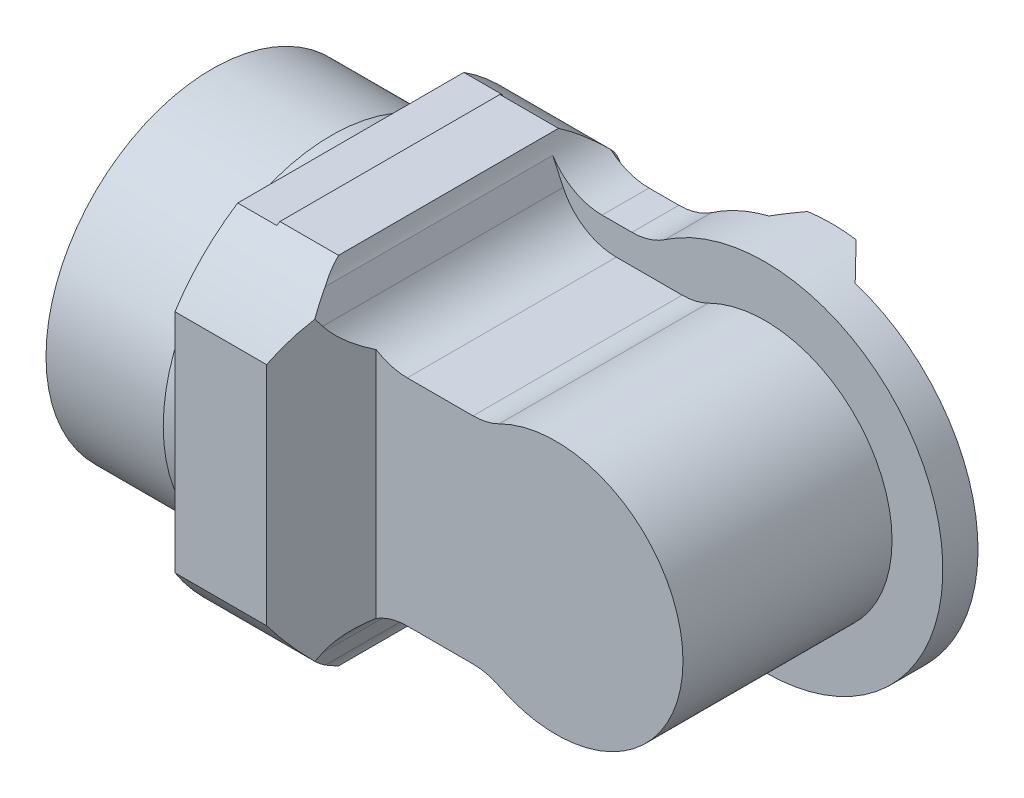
ISO-10303-21;
HEADER;
FILE_DESCRIPTION(('STEP AP214'),'2;1');
FILE_NAME('part.step','',(''),(''),'','','');
FILE_SCHEMA(('AUTOMOTIVE_DESIGN { 1 0 10303 214 1 1 1 1 }'));
ENDSEC;
DATA;
#1=APPLICATION_CONTEXT('core data for automotive mechanical design processes');
#2=APPLICATION_PROTOCOL_DEFINITION('international standard','automotive_design',2000,#1);
#3=PRODUCT_CONTEXT('',#1,'mechanical');
#4=PRODUCT('Part','Part','',(#3));
#5=PRODUCT_RELATED_PRODUCT_CATEGORY('part','',(#4));
#6=PRODUCT_DEFINITION_FORMATION('','',#4);
#7=PRODUCT_DEFINITION_CONTEXT('part definition',#1,'design');
#8=PRODUCT_DEFINITION('design','',#6,#7);
#9=PRODUCT_DEFINITION_SHAPE('','',#8);
#10=(LENGTH_UNIT() NAMED_UNIT(*) SI_UNIT(.MILLI.,.METRE.));
#11=(NAMED_UNIT(*) PLANE_ANGLE_UNIT() SI_UNIT($,.RADIAN.));
#12=(NAMED_UNIT(*) SI_UNIT($,.STERADIAN.) SOLID_ANGLE_UNIT());
#13=UNCERTAINTY_MEASURE_WITH_UNIT(LENGTH_MEASURE(1.E-05),#10,'distance_accuracy_value','');
#14=(GEOMETRIC_REPRESENTATION_CONTEXT(3) GLOBAL_UNCERTAINTY_ASSIGNED_CONTEXT((#13)) GLOBAL_UNIT_ASSIGNED_CONTEXT((#10,
#11,#12)) REPRESENTATION_CONTEXT('',''));
#15=CARTESIAN_POINT('',(0.,0.,0.));
#16=DIRECTION('',(0.,0.,1.));
#17=DIRECTION('',(1.,0.,0.));
#18=AXIS2_PLACEMENT_3D('',#15,#16,#17);
#19=CARTESIAN_POINT('',(-81.,0.,0.));
#20=DIRECTION('',(-1.,0.,0.));
#21=DIRECTION('',(0.,0.,1.));
#22=AXIS2_PLACEMENT_3D('',#19,#20,#21);
#23=PLANE('',#22);
#24=CARTESIAN_POINT('',(-81.,0.,0.));
#25=DIRECTION('',(-1.,0.,0.));
#26=DIRECTION('',(0.,0.,1.));
#27=AXIS2_PLACEMENT_3D('',#24,#25,#26);
#28=CIRCLE('',#27,53.5);
#29=CARTESIAN_POINT('',(-81.,-45.,28.9352725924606));
#30=VERTEX_POINT('',#29);
#31=CARTESIAN_POINT('',(-81.,-28.9352725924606,45.));
#32=VERTEX_POINT('',#31);
#33=EDGE_CURVE('E266',#30,#32,#28,.T.);
#34=ORIENTED_EDGE('',*,*,#33,.T.);
#35=DIRECTION('',(0.,1.,0.));
#36=VECTOR('',#35,1.);
#37=CARTESIAN_POINT('',(-81.,-28.9352725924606,45.));
#38=LINE('',#37,#36);
#39=CARTESIAN_POINT('',(-81.,28.9352725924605,45.));
#40=VERTEX_POINT('',#39);
#41=EDGE_CURVE('E277',#32,#40,#38,.T.);
#42=ORIENTED_EDGE('',*,*,#41,.T.);
#43=CARTESIAN_POINT('',(-81.,0.,0.));
#44=DIRECTION('',(-1.,0.,0.));
#45=DIRECTION('',(0.,0.,1.));
#46=AXIS2_PLACEMENT_3D('',#43,#44,#45);
#47=CIRCLE('',#46,53.5);
#48=CARTESIAN_POINT('',(-81.,45.,28.9352725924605));
#49=VERTEX_POINT('',#48);
#50=EDGE_CURVE('E284',#40,#49,#47,.T.);
#51=ORIENTED_EDGE('',*,*,#50,.T.);
#52=DIRECTION('',(0.,0.,-1.));
#53=VECTOR('',#52,1.);
#54=CARTESIAN_POINT('',(-81.,45.,28.9352725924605));
#55=LINE('',#54,#53);
#56=CARTESIAN_POINT('',(-81.,45.,-28.9352725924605));
#57=VERTEX_POINT('',#56);
#58=EDGE_CURVE('E303',#49,#57,#55,.T.);
#59=ORIENTED_EDGE('',*,*,#58,.T.);
#60=CARTESIAN_POINT('',(-81.,0.,0.));
#61=DIRECTION('',(-1.,0.,0.));
#62=DIRECTION('',(0.,0.,1.));
#63=AXIS2_PLACEMENT_3D('',#60,#61,#62);
#64=CIRCLE('',#63,53.5);
#65=CARTESIAN_POINT('',(-81.,28.9352725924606,-45.));
#66=VERTEX_POINT('',#65);
#67=EDGE_CURVE('E307',#57,#66,#64,.T.);
#68=ORIENTED_EDGE('',*,*,#67,.T.);
#69=DIRECTION('',(0.,-1.,0.));
#70=VECTOR('',#69,1.);
#71=CARTESIAN_POINT('',(-81.,28.9352725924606,-45.));
#72=LINE('',#71,#70);
#73=CARTESIAN_POINT('',(-81.,-28.9352725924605,-45.));
#74=VERTEX_POINT('',#73);
#75=EDGE_CURVE('E311',#66,#74,#72,.T.);
#76=ORIENTED_EDGE('',*,*,#75,.T.);
#77=CARTESIAN_POINT('',(-81.,0.,0.));
#78=DIRECTION('',(-1.,0.,0.));
#79=DIRECTION('',(0.,0.,1.));
#80=AXIS2_PLACEMENT_3D('',#77,#78,#79);
#81=CIRCLE('',#80,53.5);
#82=CARTESIAN_POINT('',(-81.,-45.,-28.9352725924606));
#83=VERTEX_POINT('',#82);
#84=EDGE_CURVE('E315',#74,#83,#81,.T.);
#85=ORIENTED_EDGE('',*,*,#84,.T.);
#86=DIRECTION('',(0.,0.,1.));
#87=VECTOR('',#86,1.);
#88=CARTESIAN_POINT('',(-81.,-45.,-28.9352725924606));
#89=LINE('',#88,#87);
#90=EDGE_CURVE('E289',#83,#30,#89,.T.);
#91=ORIENTED_EDGE('',*,*,#90,.T.);
#92=EDGE_LOOP('',(#34,#42,#51,#59,#68,#76,#85,#91));
#93=FACE_BOUND('',#92,.T.);
#94=CARTESIAN_POINT('',(-81.,0.,0.));
#95=DIRECTION('',(-1.,0.,0.));
#96=DIRECTION('',(0.,0.,1.));
#97=AXIS2_PLACEMENT_3D('',#94,#95,#96);
#98=CIRCLE('',#97,43.);
#99=CARTESIAN_POINT('',(-81.,0.,43.));
#100=VERTEX_POINT('',#99);
#101=EDGE_CURVE('E297',#100,#100,#98,.T.);
#102=ORIENTED_EDGE('',*,*,#101,.F.);
#103=EDGE_LOOP('',(#102));
#104=FACE_BOUND('',#103,.T.);
#105=ADVANCED_FACE('F14',(#93,#104),#23,.T.);
#106=CARTESIAN_POINT('',(-71.,0.,0.));
#107=DIRECTION('',(1.,0.,0.));
#108=DIRECTION('',(0.,0.,-1.));
#109=AXIS2_PLACEMENT_3D('',#106,#107,#108);
#110=PLANE('',#109);
#111=CARTESIAN_POINT('',(-71.,0.,0.));
#112=DIRECTION('',(-1.,0.,0.));
#113=DIRECTION('',(0.,0.,1.));
#114=AXIS2_PLACEMENT_3D('',#111,#112,#113);
#115=CIRCLE('',#114,53.5);
#116=CARTESIAN_POINT('',(-71.,-45.5,28.1424945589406));
#117=VERTEX_POINT('',#116);
#118=CARTESIAN_POINT('',(-71.,-45.,28.9352725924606));
#119=VERTEX_POINT('',#118);
#120=EDGE_CURVE('E713',#117,#119,#115,.T.);
#121=ORIENTED_EDGE('',*,*,#120,.T.);
#122=DIRECTION('',(0.,0.,-1.));
#123=VECTOR('',#122,1.);
#124=CARTESIAN_POINT('',(-71.,-45.,0.));
#125=LINE('',#124,#123);
#126=CARTESIAN_POINT('',(-71.,-45.,-28.9352725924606));
#127=VERTEX_POINT('',#126);
#128=EDGE_CURVE('E9',#119,#127,#125,.T.);
#129=ORIENTED_EDGE('',*,*,#128,.T.);
#130=CARTESIAN_POINT('',(-71.,-45.5,-28.1424945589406));
#131=VERTEX_POINT('',#130);
#132=EDGE_CURVE('E712',#127,#131,#115,.T.);
#133=ORIENTED_EDGE('',*,*,#132,.T.);
#134=DIRECTION('',(0.,0.,-1.));
#135=VECTOR('',#134,1.);
#136=CARTESIAN_POINT('',(-71.,-45.5,0.));
#137=LINE('',#136,#135);
#138=EDGE_CURVE('E741',#117,#131,#137,.T.);
#139=ORIENTED_EDGE('',*,*,#138,.F.);
#140=EDGE_LOOP('',(#121,#129,#133,#139));
#141=FACE_BOUND('',#140,.T.);
#142=ADVANCED_FACE('F569',(#141),#110,.F.);
#143=CARTESIAN_POINT('',(-71.,28.9352725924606,-45.));
#144=VERTEX_POINT('',#143);
#145=CARTESIAN_POINT('',(-71.,-28.9352725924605,-45.));
#146=VERTEX_POINT('',#145);
#147=EDGE_CURVE('E826',#144,#146,#115,.T.);
#148=ORIENTED_EDGE('',*,*,#147,.T.);
#149=DIRECTION('',(0.,1.,0.));
#150=VECTOR('',#149,1.);
#151=CARTESIAN_POINT('',(-71.,0.,-45.));
#152=LINE('',#151,#150);
#153=EDGE_CURVE('E23',#146,#144,#152,.T.);
#154=ORIENTED_EDGE('',*,*,#153,.T.);
#155=EDGE_LOOP('',(#148,#154));
#156=FACE_BOUND('',#155,.T.);
#157=ADVANCED_FACE('F570',(#156),#110,.F.);
#158=CARTESIAN_POINT('',(-41.,0.,0.));
#159=DIRECTION('',(-1.,0.,0.));
#160=DIRECTION('',(0.,0.,1.));
#161=AXIS2_PLACEMENT_3D('',#158,#159,#160);
#162=CYLINDRICAL_SURFACE('',#161,53.5);
#163=DIRECTION('',(-1.,0.,0.));
#164=VECTOR('',#163,1.);
#165=CARTESIAN_POINT('',(-68.,-45.,28.9352725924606));
#166=LINE('',#165,#164);
#167=EDGE_CURVE('E321',#119,#30,#166,.T.);
#168=ORIENTED_EDGE('',*,*,#167,.F.);
#169=ORIENTED_EDGE('',*,*,#120,.F.);
#170=DIRECTION('',(-1.,0.,0.));
#171=VECTOR('',#170,1.);
#172=CARTESIAN_POINT('',(-41.,-45.5,28.1424945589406));
#173=LINE('',#172,#171);
#174=CARTESIAN_POINT('',(-56.,-45.5,28.1424945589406));
#175=VERTEX_POINT('',#174);
#176=EDGE_CURVE('E689',#117,#175,#173,.F.);
#177=ORIENTED_EDGE('',*,*,#176,.T.);
#178=CARTESIAN_POINT('',(-56.,-45.5,28.1424945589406));
#179=CARTESIAN_POINT('',(-55.9486941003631,-45.3368762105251,28.4062321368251));
#180=CARTESIAN_POINT('',(-55.89371488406,-45.1717815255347,28.668021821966));
#181=CARTESIAN_POINT('',(-55.7757989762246,-44.8378931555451,29.1874745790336));
#182=CARTESIAN_POINT('',(-55.7128610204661,-44.6690988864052,29.4451369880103));
#183=CARTESIAN_POINT('',(-55.5109680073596,-44.1569742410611,30.2124142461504));
#184=CARTESIAN_POINT('',(-55.3591205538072,-43.8085122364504,30.7153336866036));
#185=CARTESIAN_POINT('',(-55.0141959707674,-43.0972390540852,31.7057400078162));
#186=CARTESIAN_POINT('',(-54.8206705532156,-42.7343099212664,32.19298701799));
#187=CARTESIAN_POINT('',(-54.3882561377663,-42.0026378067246,33.1419170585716));
#188=CARTESIAN_POINT('',(-54.1494065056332,-41.6339001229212,33.6036218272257));
#189=CARTESIAN_POINT('',(-53.697173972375,-41.0025541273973,34.368753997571));
#190=CARTESIAN_POINT('',(-53.4962137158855,-40.7399139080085,34.6795215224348));
#191=CARTESIAN_POINT('',(-53.0669559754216,-40.2173654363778,35.2841756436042));
#192=CARTESIAN_POINT('',(-52.83865706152,-39.957457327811,35.5780613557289));
#193=CARTESIAN_POINT('',(-52.3543475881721,-39.4446690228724,36.1457306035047));
#194=CARTESIAN_POINT('',(-52.0984516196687,-39.1917648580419,36.4195899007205));
#195=CARTESIAN_POINT('',(-51.5573112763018,-38.6956278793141,36.9463017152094));
#196=CARTESIAN_POINT('',(-51.2720722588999,-38.4523933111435,37.1991580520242));
#197=CARTESIAN_POINT('',(-50.7202237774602,-38.0177513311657,37.642808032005));
#198=CARTESIAN_POINT('',(-50.4579905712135,-37.8242981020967,37.8370442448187));
#199=CARTESIAN_POINT('',(-49.9129403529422,-37.4497995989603,38.2077466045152));
#200=CARTESIAN_POINT('',(-49.630127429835,-37.2687518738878,38.384216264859));
#201=CARTESIAN_POINT('',(-49.0443000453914,-36.9216321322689,38.7182280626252));
#202=CARTESIAN_POINT('',(-48.7412659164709,-36.7555750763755,38.8757513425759));
#203=CARTESIAN_POINT('',(-48.1164775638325,-36.4414476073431,39.1703623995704));
#204=CARTESIAN_POINT('',(-47.7947237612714,-36.2933767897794,39.3074506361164));
#205=CARTESIAN_POINT('',(-47.1317831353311,-36.0169084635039,39.5609375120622));
#206=CARTESIAN_POINT('',(-46.7904686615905,-35.8886668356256,39.6771732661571));
#207=CARTESIAN_POINT('',(-46.0929418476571,-35.6557563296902,39.8866094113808));
#208=CARTESIAN_POINT('',(-45.7367271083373,-35.5510912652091,39.9798060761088));
#209=CARTESIAN_POINT('',(-45.0130845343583,-35.3677678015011,40.1420725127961));
#210=CARTESIAN_POINT('',(-44.6456803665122,-35.2890581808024,40.2111898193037));
#211=CARTESIAN_POINT('',(-43.9024988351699,-35.1591436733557,40.3248322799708));
#212=CARTESIAN_POINT('',(-43.5267273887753,-35.1079199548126,40.3693742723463));
#213=CARTESIAN_POINT('',(-42.9067780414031,-35.0473830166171,40.4219235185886));
#214=CARTESIAN_POINT('',(-42.6639982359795,-35.0296180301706,40.4373129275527));
#215=CARTESIAN_POINT('',(-42.1777956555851,-35.0059282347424,40.4578183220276));
#216=CARTESIAN_POINT('',(-41.9343743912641,-34.9999857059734,40.4629496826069));
#217=CARTESIAN_POINT('',(-41.6909119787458,-35.,40.4629460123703));
#218=B_SPLINE_CURVE_WITH_KNOTS('',3,(#178,#179,#180,#181,#182,#183,#184,#185,#186,#187,#188,
#189,#190,#191,#192,#193,#194,#195,#196,#197,#198,#199,#200,#201,#202,#203,#204,#205,#206,#207,
#208,#209,#210,#211,#212,#213,#214,#215,#216,#217),.UNSPECIFIED.,.F.,.F.,(4,2,2,2,2,2,2,2,2,2,2,
2,2,2,2,2,2,2,2,4),(0.,0.94290375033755,1.88595746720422,3.77558062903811,5.68664564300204,
7.59605836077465,8.956482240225,10.3169773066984,11.6720261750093,13.0268280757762,
14.1638414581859,15.3006295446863,16.4385398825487,17.5764246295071,18.7228436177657,
19.8694479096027,21.0137757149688,22.1573184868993,22.8885958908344,23.6187764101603),.UNSPECIFIED.);
#219=CARTESIAN_POINT('',(-54.3358164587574,-41.9311468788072,33.2269306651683));
#220=VERTEX_POINT('',#219);
#221=EDGE_CURVE('E528',#175,#220,#218,.T.);
#222=ORIENTED_EDGE('',*,*,#221,.T.);
#223=CARTESIAN_POINT('',(-34.7830015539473,0.,0.));
#224=DIRECTION('',(-0.906307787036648,0.422618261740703,0.));
#225=DIRECTION('',(-0.422618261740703,-0.906307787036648,0.));
#226=AXIS2_PLACEMENT_3D('',#223,#224,#225);
#227=ELLIPSE('',#226,59.0307186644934,53.5);
#228=CARTESIAN_POINT('',(-52.4672525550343,-37.9239986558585,37.73619384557));
#229=VERTEX_POINT('',#228);
#230=EDGE_CURVE('E473',#229,#220,#227,.F.);
#231=ORIENTED_EDGE('',*,*,#230,.F.);
#232=CARTESIAN_POINT('',(-26.0440851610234,0.,0.));
#233=DIRECTION('',(-0.819152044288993,0.,-0.573576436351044));
#234=DIRECTION('',(-0.573576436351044,0.,0.819152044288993));
#235=AXIS2_PLACEMENT_3D('',#232,#233,#234);
#236=ELLIPSE('',#235,65.3114404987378,53.5);
#237=CARTESIAN_POINT('',(-57.5534243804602,-28.9352725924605,45.));
#238=VERTEX_POINT('',#237);
#239=EDGE_CURVE('E269',#238,#229,#236,.F.);
#240=ORIENTED_EDGE('',*,*,#239,.F.);
#241=DIRECTION('',(-1.,0.,0.));
#242=VECTOR('',#241,1.);
#243=CARTESIAN_POINT('',(-41.,-28.9352725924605,45.));
#244=LINE('',#243,#242);
#245=EDGE_CURVE('E261',#32,#238,#244,.F.);
#246=ORIENTED_EDGE('',*,*,#245,.F.);
#247=ORIENTED_EDGE('',*,*,#33,.F.);
#248=EDGE_LOOP('',(#168,#169,#177,#222,#231,#240,#246,#247));
#249=FACE_BOUND('',#248,.T.);
#250=ADVANCED_FACE('F264',(#249),#162,.T.);
#251=CARTESIAN_POINT('',(-41.6909119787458,35.,-50.));
#252=DIRECTION('',(0.,1.,0.));
#253=DIRECTION('',(0.,0.,1.));
#254=AXIS2_PLACEMENT_3D('',#251,#252,#253);
#255=PLANE('',#254);
#256=DIRECTION('',(0.,0.,1.));
#257=VECTOR('',#256,1.);
#258=CARTESIAN_POINT('',(-41.6909119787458,35.,-50.));
#259=LINE('',#258,#257);
#260=CARTESIAN_POINT('',(-41.6909119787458,35.,-37.));
#261=VERTEX_POINT('',#260);
#262=CARTESIAN_POINT('',(-41.6909119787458,35.,-25.));
#263=VERTEX_POINT('',#262);
#264=EDGE_CURVE('E496',#261,#263,#259,.T.);
#265=ORIENTED_EDGE('',*,*,#264,.T.);
#266=DIRECTION('',(1.,0.,0.));
#267=VECTOR('',#266,1.);
#268=CARTESIAN_POINT('',(-41.6909119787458,35.,-25.));
#269=LINE('',#268,#267);
#270=CARTESIAN_POINT('',(-34.0624426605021,35.,-25.));
#271=VERTEX_POINT('',#270);
#272=EDGE_CURVE('E461',#263,#271,#269,.T.);
#273=ORIENTED_EDGE('',*,*,#272,.T.);
#274=DIRECTION('',(0.,0.,1.));
#275=VECTOR('',#274,1.);
#276=CARTESIAN_POINT('',(-34.0624426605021,35.,-50.));
#277=LINE('',#276,#275);
#278=CARTESIAN_POINT('',(-34.0624426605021,35.,-37.));
#279=VERTEX_POINT('',#278);
#280=EDGE_CURVE('E500',#279,#271,#277,.T.);
#281=ORIENTED_EDGE('',*,*,#280,.F.);
#282=DIRECTION('',(-1.,0.,0.));
#283=VECTOR('',#282,1.);
#284=CARTESIAN_POINT('',(-46.,35.,-37.));
#285=LINE('',#284,#283);
#286=EDGE_CURVE('E735',#279,#261,#285,.T.);
#287=ORIENTED_EDGE('',*,*,#286,.T.);
#288=EDGE_LOOP('',(#265,#273,#281,#287));
#289=FACE_BOUND('',#288,.T.);
#290=ADVANCED_FACE('F670',(#289),#255,.T.);
#291=CARTESIAN_POINT('',(-34.0624426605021,50.,-50.));
#292=DIRECTION('',(0.,0.,1.));
#293=DIRECTION('',(1.,0.,0.));
#294=AXIS2_PLACEMENT_3D('',#291,#292,#293);
#295=CYLINDRICAL_SURFACE('',#294,15.);
#296=ORIENTED_EDGE('',*,*,#280,.T.);
#297=CARTESIAN_POINT('',(-34.0624426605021,50.,-25.));
#298=DIRECTION('',(0.,0.,1.));
#299=DIRECTION('',(1.,0.,0.));
#300=AXIS2_PLACEMENT_3D('',#297,#298,#299);
#301=CIRCLE('',#300,15.);
#302=CARTESIAN_POINT('',(-25.6172089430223,37.603305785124,-25.));
#303=VERTEX_POINT('',#302);
#304=EDGE_CURVE('E457',#271,#303,#301,.T.);
#305=ORIENTED_EDGE('',*,*,#304,.T.);
#306=DIRECTION('',(0.,0.,1.));
#307=VECTOR('',#306,1.);
#308=CARTESIAN_POINT('',(-25.6172089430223,37.603305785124,-50.));
#309=LINE('',#308,#307);
#310=CARTESIAN_POINT('',(-25.6172089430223,37.603305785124,-37.));
#311=VERTEX_POINT('',#310);
#312=EDGE_CURVE('E504',#311,#303,#309,.T.);
#313=ORIENTED_EDGE('',*,*,#312,.F.);
#314=CARTESIAN_POINT('',(-34.0624426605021,50.,-37.));
#315=DIRECTION('',(0.,0.,1.));
#316=DIRECTION('',(1.,0.,0.));
#317=AXIS2_PLACEMENT_3D('',#314,#315,#316);
#318=CIRCLE('',#317,15.);
#319=EDGE_CURVE('E732',#311,#279,#318,.F.);
#320=ORIENTED_EDGE('',*,*,#319,.T.);
#321=EDGE_LOOP('',(#296,#305,#313,#320));
#322=FACE_BOUND('',#321,.T.);
#323=ADVANCED_FACE('F1170',(#322),#295,.F.);
#324=CARTESIAN_POINT('',(0.,0.,-50.));
#325=DIRECTION('',(0.,0.,1.));
#326=DIRECTION('',(1.,0.,0.));
#327=AXIS2_PLACEMENT_3D('',#324,#325,#326);
#328=CYLINDRICAL_SURFACE('',#327,45.5);
#329=CARTESIAN_POINT('',(0.,0.,-37.));
#330=DIRECTION('',(0.,0.,1.));
#331=DIRECTION('',(1.,0.,0.));
#332=AXIS2_PLACEMENT_3D('',#329,#330,#331);
#333=CIRCLE('',#332,45.5);
#334=CARTESIAN_POINT('',(-25.6172089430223,-37.603305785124,-37.));
#335=VERTEX_POINT('',#334);
#336=CARTESIAN_POINT('',(-16.8828473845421,-42.2518575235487,-37.));
#337=VERTEX_POINT('',#336);
#338=EDGE_CURVE('E729',#335,#337,#333,.T.);
#339=ORIENTED_EDGE('',*,*,#338,.T.);
#340=CARTESIAN_POINT('',(0.,0.,-34.));
#341=DIRECTION('',(-0.672498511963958,0.218508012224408,0.707106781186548));
#342=DIRECTION('',(0.672498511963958,-0.218508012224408,0.707106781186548));
#343=AXIS2_PLACEMENT_3D('',#340,#341,#342);
#344=ELLIPSE('',#343,64.3467170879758,45.5);
#345=CARTESIAN_POINT('',(-14.0602732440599,-43.2730714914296,-34.));
#346=VERTEX_POINT('',#345);
#347=EDGE_CURVE('E814',#337,#346,#344,.T.);
#348=ORIENTED_EDGE('',*,*,#347,.T.);
#349=CARTESIAN_POINT('',(0.,0.,-34.));
#350=DIRECTION('',(0.,0.,-1.));
#351=DIRECTION('',(0.,1.,0.));
#352=AXIS2_PLACEMENT_3D('',#349,#350,#351);
#353=CIRCLE('',#352,45.5);
#354=CARTESIAN_POINT('',(14.0602732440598,43.2730714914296,-34.));
#355=VERTEX_POINT('',#354);
#356=EDGE_CURVE('E324',#355,#346,#353,.T.);
#357=ORIENTED_EDGE('',*,*,#356,.F.);
#358=CARTESIAN_POINT('',(0.,0.,-34.));
#359=DIRECTION('',(-0.672498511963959,0.218508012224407,0.707106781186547));
#360=DIRECTION('',(0.672498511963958,-0.218508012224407,0.707106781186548));
#361=AXIS2_PLACEMENT_3D('',#358,#359,#360);
#362=ELLIPSE('',#361,64.3467170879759,45.5);
#363=CARTESIAN_POINT('',(6.23278435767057,45.0710816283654,-42.));
#364=VERTEX_POINT('',#363);
#365=EDGE_CURVE('E807',#355,#364,#362,.T.);
#366=ORIENTED_EDGE('',*,*,#365,.T.);
#367=CARTESIAN_POINT('',(0.,0.,-42.));
#368=DIRECTION('',(0.,0.,-1.));
#369=DIRECTION('',(0.,-1.,0.));
#370=AXIS2_PLACEMENT_3D('',#367,#368,#369);
#371=CIRCLE('',#370,45.5);
#372=CARTESIAN_POINT('',(-6.08930369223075,45.0906906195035,-42.));
#373=VERTEX_POINT('',#372);
#374=EDGE_CURVE('E484',#373,#364,#371,.T.);
#375=ORIENTED_EDGE('',*,*,#374,.F.);
#376=CARTESIAN_POINT('',(0.,0.,-37.));
#377=DIRECTION('',(0.686102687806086,0.171064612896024,0.707106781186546));
#378=DIRECTION('',(-0.686102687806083,-0.171064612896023,0.707106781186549));
#379=AXIS2_PLACEMENT_3D('',#376,#377,#378);
#380=ELLIPSE('',#379,64.3467170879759,45.5);
#381=CARTESIAN_POINT('',(-11.0074462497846,44.1484555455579,-37.));
#382=VERTEX_POINT('',#381);
#383=EDGE_CURVE('E793',#373,#382,#380,.T.);
#384=ORIENTED_EDGE('',*,*,#383,.T.);
#385=EDGE_CURVE('E728',#382,#311,#333,.T.);
#386=ORIENTED_EDGE('',*,*,#385,.T.);
#387=ORIENTED_EDGE('',*,*,#312,.T.);
#388=CARTESIAN_POINT('',(0.,0.,-25.));
#389=DIRECTION('',(0.,0.,1.));
#390=DIRECTION('',(1.,0.,0.));
#391=AXIS2_PLACEMENT_3D('',#388,#389,#390);
#392=CIRCLE('',#391,45.5);
#393=CARTESIAN_POINT('',(-25.6172089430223,-37.603305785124,-25.));
#394=VERTEX_POINT('',#393);
#395=EDGE_CURVE('E453',#303,#394,#392,.F.);
#396=ORIENTED_EDGE('',*,*,#395,.T.);
#397=DIRECTION('',(0.,0.,1.));
#398=VECTOR('',#397,1.);
#399=CARTESIAN_POINT('',(-25.6172089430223,-37.603305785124,-50.));
#400=LINE('',#399,#398);
#401=EDGE_CURVE('E508',#335,#394,#400,.T.);
#402=ORIENTED_EDGE('',*,*,#401,.F.);
#403=EDGE_LOOP('',(#339,#348,#357,#366,#375,#384,#386,#387,#396,#402));
#404=FACE_BOUND('',#403,.T.);
#405=ADVANCED_FACE('F1160',(#404),#328,.T.);
#406=CARTESIAN_POINT('',(-34.0624426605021,-50.,-50.));
#407=DIRECTION('',(0.,0.,1.));
#408=DIRECTION('',(1.,0.,0.));
#409=AXIS2_PLACEMENT_3D('',#406,#407,#408);
#410=CYLINDRICAL_SURFACE('',#409,15.);
#411=ORIENTED_EDGE('',*,*,#401,.T.);
#412=CARTESIAN_POINT('',(-34.0624426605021,-50.,-25.));
#413=DIRECTION('',(0.,0.,1.));
#414=DIRECTION('',(1.,0.,0.));
#415=AXIS2_PLACEMENT_3D('',#412,#413,#414);
#416=CIRCLE('',#415,15.);
#417=CARTESIAN_POINT('',(-34.0624426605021,-35.,-25.));
#418=VERTEX_POINT('',#417);
#419=EDGE_CURVE('E449',#394,#418,#416,.T.);
#420=ORIENTED_EDGE('',*,*,#419,.T.);
#421=DIRECTION('',(0.,0.,1.));
#422=VECTOR('',#421,1.);
#423=CARTESIAN_POINT('',(-34.0624426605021,-35.,-50.));
#424=LINE('',#423,#422);
#425=CARTESIAN_POINT('',(-34.0624426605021,-35.,-37.));
#426=VERTEX_POINT('',#425);
#427=EDGE_CURVE('E512',#426,#418,#424,.T.);
#428=ORIENTED_EDGE('',*,*,#427,.F.);
#429=CARTESIAN_POINT('',(-34.0624426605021,-50.,-37.));
#430=DIRECTION('',(0.,0.,1.));
#431=DIRECTION('',(1.,0.,0.));
#432=AXIS2_PLACEMENT_3D('',#429,#430,#431);
#433=CIRCLE('',#432,15.);
#434=EDGE_CURVE('E725',#426,#335,#433,.F.);
#435=ORIENTED_EDGE('',*,*,#434,.T.);
#436=EDGE_LOOP('',(#411,#420,#428,#435));
#437=FACE_BOUND('',#436,.T.);
#438=ADVANCED_FACE('F1151',(#437),#410,.F.);
#439=CARTESIAN_POINT('',(-41.6909119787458,-35.,-50.));
#440=DIRECTION('',(0.,-1.,0.));
#441=DIRECTION('',(0.,0.,-1.));
#442=AXIS2_PLACEMENT_3D('',#439,#440,#441);
#443=PLANE('',#442);
#444=ORIENTED_EDGE('',*,*,#427,.T.);
#445=DIRECTION('',(-1.,0.,0.));
#446=VECTOR('',#445,1.);
#447=CARTESIAN_POINT('',(-41.6909119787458,-35.,-25.));
#448=LINE('',#447,#446);
#449=CARTESIAN_POINT('',(-41.6909119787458,-35.,-25.));
#450=VERTEX_POINT('',#449);
#451=EDGE_CURVE('E445',#418,#450,#448,.T.);
#452=ORIENTED_EDGE('',*,*,#451,.T.);
#453=DIRECTION('',(0.,0.,1.));
#454=VECTOR('',#453,1.);
#455=CARTESIAN_POINT('',(-41.6909119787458,-35.,-50.));
#456=LINE('',#455,#454);
#457=CARTESIAN_POINT('',(-41.6909119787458,-35.,-37.));
#458=VERTEX_POINT('',#457);
#459=EDGE_CURVE('E516',#458,#450,#456,.T.);
#460=ORIENTED_EDGE('',*,*,#459,.F.);
#461=DIRECTION('',(1.,0.,0.));
#462=VECTOR('',#461,1.);
#463=CARTESIAN_POINT('',(-46.,-35.,-37.));
#464=LINE('',#463,#462);
#465=EDGE_CURVE('E722',#458,#426,#464,.T.);
#466=ORIENTED_EDGE('',*,*,#465,.T.);
#467=EDGE_LOOP('',(#444,#452,#460,#466));
#468=FACE_BOUND('',#467,.T.);
#469=ADVANCED_FACE('F544',(#468),#443,.T.);
#470=CARTESIAN_POINT('',(-46.,119.1,-37.));
#471=DIRECTION('',(0.,0.,1.));
#472=DIRECTION('',(1.,0.,0.));
#473=AXIS2_PLACEMENT_3D('',#470,#471,#472);
#474=PLANE('',#473);
#475=CARTESIAN_POINT('',(0.,0.,-37.));
#476=DIRECTION('',(0.,0.,-1.));
#477=DIRECTION('',(-1.,0.,0.));
#478=AXIS2_PLACEMENT_3D('',#475,#476,#477);
#479=CIRCLE('',#478,43.5);
#480=CARTESIAN_POINT('',(-16.263403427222,-40.345405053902,-37.));
#481=VERTEX_POINT('',#480);
#482=CARTESIAN_POINT('',(-10.5236024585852,42.2078640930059,-37.));
#483=VERTEX_POINT('',#482);
#484=EDGE_CURVE('E701',#481,#483,#479,.T.);
#485=ORIENTED_EDGE('',*,*,#484,.F.);
#486=DIRECTION('',(-0.309016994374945,-0.951056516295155,0.));
#487=VECTOR('',#486,1.);
#488=CARTESIAN_POINT('',(27.7568330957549,95.1349521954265,-37.));
#489=LINE('',#488,#487);
#490=EDGE_CURVE('E30',#481,#337,#489,.T.);
#491=ORIENTED_EDGE('',*,*,#490,.T.);
#492=ORIENTED_EDGE('',*,*,#338,.F.);
#493=ORIENTED_EDGE('',*,*,#434,.F.);
#494=ORIENTED_EDGE('',*,*,#465,.F.);
#495=CARTESIAN_POINT('',(-41.6909119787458,-50.,-37.));
#496=DIRECTION('',(0.,0.,1.));
#497=DIRECTION('',(1.,0.,0.));
#498=AXIS2_PLACEMENT_3D('',#495,#496,#497);
#499=CIRCLE('',#498,15.);
#500=CARTESIAN_POINT('',(-51.4465756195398,-38.6058336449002,-37.));
#501=VERTEX_POINT('',#500);
#502=EDGE_CURVE('E717',#501,#458,#499,.F.);
#503=ORIENTED_EDGE('',*,*,#502,.F.);
#504=DIRECTION('',(0.,1.,0.));
#505=VECTOR('',#504,1.);
#506=CARTESIAN_POINT('',(-51.4465756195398,-104.8,-37.));
#507=LINE('',#506,#505);
#508=CARTESIAN_POINT('',(-51.4465756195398,38.6058336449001,-37.));
#509=VERTEX_POINT('',#508);
#510=EDGE_CURVE('E273',#501,#509,#507,.T.);
#511=ORIENTED_EDGE('',*,*,#510,.T.);
#512=CARTESIAN_POINT('',(-41.6909119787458,50.,-37.));
#513=DIRECTION('',(0.,0.,1.));
#514=DIRECTION('',(1.,0.,0.));
#515=AXIS2_PLACEMENT_3D('',#512,#513,#514);
#516=CIRCLE('',#515,15.);
#517=EDGE_CURVE('E738',#261,#509,#516,.F.);
#518=ORIENTED_EDGE('',*,*,#517,.F.);
#519=ORIENTED_EDGE('',*,*,#286,.F.);
#520=ORIENTED_EDGE('',*,*,#319,.F.);
#521=ORIENTED_EDGE('',*,*,#385,.F.);
#522=DIRECTION('',(-0.24192189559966,0.970295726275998,0.));
#523=VECTOR('',#522,1.);
#524=CARTESIAN_POINT('',(-11.0074462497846,44.1484555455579,-37.));
#525=LINE('',#524,#523);
#526=EDGE_CURVE('E480',#483,#382,#525,.T.);
#527=ORIENTED_EDGE('',*,*,#526,.F.);
#528=EDGE_LOOP('',(#485,#491,#492,#493,#494,#503,#511,#518,#519,#520,#521,#527));
#529=FACE_BOUND('',#528,.T.);
#530=ADVANCED_FACE('F560',(#529),#474,.F.);
#531=ORIENTED_EDGE('',*,*,#50,.F.);
#532=DIRECTION('',(-1.,0.,0.));
#533=VECTOR('',#532,1.);
#534=CARTESIAN_POINT('',(-41.,28.9352725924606,45.));
#535=LINE('',#534,#533);
#536=CARTESIAN_POINT('',(-57.5534243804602,28.9352725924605,45.));
#537=VERTEX_POINT('',#536);
#538=EDGE_CURVE('E274',#537,#40,#535,.T.);
#539=ORIENTED_EDGE('',*,*,#538,.F.);
#540=CARTESIAN_POINT('',(-52.4672525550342,37.9239986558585,37.73619384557));
#541=VERTEX_POINT('',#540);
#542=EDGE_CURVE('E369',#541,#537,#236,.F.);
#543=ORIENTED_EDGE('',*,*,#542,.F.);
#544=CARTESIAN_POINT('',(-34.7830015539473,0.,0.));
#545=DIRECTION('',(-0.906307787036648,-0.422618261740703,0.));
#546=DIRECTION('',(-0.422618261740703,0.906307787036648,0.));
#547=AXIS2_PLACEMENT_3D('',#544,#545,#546);
#548=ELLIPSE('',#547,59.0307186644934,53.5);
#549=CARTESIAN_POINT('',(-54.3358164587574,41.9311468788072,33.2269306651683));
#550=VERTEX_POINT('',#549);
#551=EDGE_CURVE('E476',#550,#541,#548,.F.);
#552=ORIENTED_EDGE('',*,*,#551,.F.);
#553=CARTESIAN_POINT('',(-41.6909119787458,35.,40.4629460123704));
#554=CARTESIAN_POINT('',(-41.8605177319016,34.9999981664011,40.4629458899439));
#555=CARTESIAN_POINT('',(-42.0301001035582,35.0028773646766,40.4604573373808));
#556=CARTESIAN_POINT('',(-42.3689177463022,35.0143723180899,40.4505106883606));
#557=CARTESIAN_POINT('',(-42.538153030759,35.0229878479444,40.443052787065));
#558=CARTESIAN_POINT('',(-43.0447080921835,35.0573874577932,40.4132474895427));
#559=CARTESIAN_POINT('',(-43.3810782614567,35.0917246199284,40.383468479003));
#560=CARTESIAN_POINT('',(-44.0467499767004,35.182363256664,40.3045267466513));
#561=CARTESIAN_POINT('',(-44.3760783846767,35.2385544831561,40.2554613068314));
#562=CARTESIAN_POINT('',(-45.0270296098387,35.371921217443,40.1383240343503));
#563=CARTESIAN_POINT('',(-45.3486520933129,35.4490976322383,40.0702513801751));
#564=CARTESIAN_POINT('',(-45.98161986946,35.6230235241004,39.9157073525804));
#565=CARTESIAN_POINT('',(-46.2929757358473,35.7197520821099,39.8292556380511));
#566=CARTESIAN_POINT('',(-46.9038902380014,35.9312629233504,39.6385494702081));
#567=CARTESIAN_POINT('',(-47.2034477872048,36.0460468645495,39.5342933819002));
#568=CARTESIAN_POINT('',(-47.7893591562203,36.2919742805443,39.3086561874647));
#569=CARTESIAN_POINT('',(-48.0757031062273,36.4231297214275,39.187262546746));
#570=CARTESIAN_POINT('',(-48.6337035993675,36.699825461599,38.9282507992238));
#571=CARTESIAN_POINT('',(-48.9053597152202,36.8453661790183,38.7906322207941));
#572=CARTESIAN_POINT('',(-49.4450993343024,37.1557846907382,38.4934525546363));
#573=CARTESIAN_POINT('',(-49.7124556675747,37.3212414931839,38.3331772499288));
#574=CARTESIAN_POINT('',(-50.2295303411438,37.6635424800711,37.996909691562));
#575=CARTESIAN_POINT('',(-50.479242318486,37.8403907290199,37.8209118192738));
#576=CARTESIAN_POINT('',(-50.9605619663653,38.2032041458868,37.4543940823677));
#577=CARTESIAN_POINT('',(-51.1921744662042,38.3891668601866,37.2638781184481));
#578=CARTESIAN_POINT('',(-51.6374093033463,38.7682273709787,36.8693567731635));
#579=CARTESIAN_POINT('',(-51.8510277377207,38.9613267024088,36.6653484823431));
#580=CARTESIAN_POINT('',(-52.3701583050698,39.4575714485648,36.13231491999));
#581=CARTESIAN_POINT('',(-52.6636416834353,39.7642870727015,35.794831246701));
#582=CARTESIAN_POINT('',(-53.2106336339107,40.3840220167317,35.0941562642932));
#583=CARTESIAN_POINT('',(-53.4641230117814,40.6970442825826,34.7309527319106));
#584=CARTESIAN_POINT('',(-53.9345003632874,41.3253766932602,33.980927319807));
#585=CARTESIAN_POINT('',(-54.1512583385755,41.6406910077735,33.5940278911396));
#586=CARTESIAN_POINT('',(-54.5501615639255,42.2683779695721,32.8007621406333));
#587=CARTESIAN_POINT('',(-54.7323140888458,42.5807512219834,32.3943999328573));
#588=CARTESIAN_POINT('',(-55.0212399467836,43.1174826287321,31.6745578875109));
#589=CARTESIAN_POINT('',(-55.1352028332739,43.3432493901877,31.3649678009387));
#590=CARTESIAN_POINT('',(-55.3475273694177,43.7904815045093,30.7374712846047));
#591=CARTESIAN_POINT('',(-55.4458898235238,44.0119470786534,30.4195652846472));
#592=CARTESIAN_POINT('',(-55.62752866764,44.4478798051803,29.7789317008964));
#593=CARTESIAN_POINT('',(-55.7109252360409,44.6623902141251,29.4562673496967));
#594=CARTESIAN_POINT('',(-55.8648251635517,45.0856581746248,28.804249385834));
#595=CARTESIAN_POINT('',(-55.9353311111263,45.2944168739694,28.474897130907));
#596=CARTESIAN_POINT('',(-56.,45.5,28.1424945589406));
#597=B_SPLINE_CURVE_WITH_KNOTS('',3,(#553,#554,#555,#556,#557,#558,#559,#560,#561,#562,#563,
#564,#565,#566,#567,#568,#569,#570,#571,#572,#573,#574,#575,#576,#577,#578,#579,#580,#581,#582,
#583,#584,#585,#586,#587,#588,#589,#590,#591,#592,#593,#594,#595,#596),.UNSPECIFIED.,.F.,.F.,(4,
2,2,2,2,2,2,2,2,2,2,2,2,2,2,2,2,2,2,2,2,4),(0.,0.508728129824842,1.01743628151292,
2.03425121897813,3.04600176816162,4.05779605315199,5.06851348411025,6.07932378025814,
7.09087726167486,8.10246015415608,9.16014938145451,10.2182181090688,11.2760035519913,
12.3340178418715,13.9584484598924,15.5836563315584,17.2145011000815,18.845002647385,
20.043863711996,21.2426629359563,22.4313569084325,23.6198119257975),.UNSPECIFIED.);
#598=CARTESIAN_POINT('',(-56.,45.5,28.1424945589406));
#599=VERTEX_POINT('',#598);
#600=EDGE_CURVE('E678',#550,#599,#597,.T.);
#601=ORIENTED_EDGE('',*,*,#600,.T.);
#602=DIRECTION('',(-1.,0.,0.));
#603=VECTOR('',#602,1.);
#604=CARTESIAN_POINT('',(-41.,45.5,28.1424945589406));
#605=LINE('',#604,#603);
#606=CARTESIAN_POINT('',(-71.,45.5,28.1424945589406));
#607=VERTEX_POINT('',#606);
#608=EDGE_CURVE('E693',#599,#607,#605,.T.);
#609=ORIENTED_EDGE('',*,*,#608,.T.);
#610=CARTESIAN_POINT('',(-71.,45.,28.9352725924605));
#611=VERTEX_POINT('',#610);
#612=EDGE_CURVE('E718',#611,#607,#115,.T.);
#613=ORIENTED_EDGE('',*,*,#612,.F.);
#614=DIRECTION('',(-1.,0.,0.));
#615=VECTOR('',#614,1.);
#616=CARTESIAN_POINT('',(-68.,45.,28.9352725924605));
#617=LINE('',#616,#615);
#618=EDGE_CURVE('E320',#611,#49,#617,.T.);
#619=ORIENTED_EDGE('',*,*,#618,.T.);
#620=EDGE_LOOP('',(#531,#539,#543,#552,#601,#609,#613,#619));
#621=FACE_BOUND('',#620,.T.);
#622=ADVANCED_FACE('F533',(#621),#162,.T.);
#623=DIRECTION('',(-1.,0.,0.));
#624=VECTOR('',#623,1.);
#625=CARTESIAN_POINT('',(-68.,45.,-28.9352725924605));
#626=LINE('',#625,#624);
#627=CARTESIAN_POINT('',(-71.,45.,-28.9352725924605));
#628=VERTEX_POINT('',#627);
#629=EDGE_CURVE('E334',#628,#57,#626,.T.);
#630=ORIENTED_EDGE('',*,*,#629,.F.);
#631=CARTESIAN_POINT('',(-71.,45.5,-28.1424945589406));
#632=VERTEX_POINT('',#631);
#633=EDGE_CURVE('E719',#632,#628,#115,.T.);
#634=ORIENTED_EDGE('',*,*,#633,.F.);
#635=DIRECTION('',(-1.,0.,0.));
#636=VECTOR('',#635,1.);
#637=CARTESIAN_POINT('',(-41.,45.5,-28.1424945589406));
#638=LINE('',#637,#636);
#639=CARTESIAN_POINT('',(-56.,45.5,-28.1424945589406));
#640=VERTEX_POINT('',#639);
#641=EDGE_CURVE('E697',#632,#640,#638,.F.);
#642=ORIENTED_EDGE('',*,*,#641,.T.);
#643=CARTESIAN_POINT('',(-56.,45.5,-28.1424945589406));
#644=CARTESIAN_POINT('',(-55.9486941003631,45.3368762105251,-28.4062321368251));
#645=CARTESIAN_POINT('',(-55.89371488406,45.1717815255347,-28.668021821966));
#646=CARTESIAN_POINT('',(-55.7757989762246,44.8378931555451,-29.1874745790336));
#647=CARTESIAN_POINT('',(-55.7128610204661,44.6690988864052,-29.4451369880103));
#648=CARTESIAN_POINT('',(-55.5109680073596,44.1569742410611,-30.2124142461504));
#649=CARTESIAN_POINT('',(-55.3591205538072,43.8085122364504,-30.7153336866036));
#650=CARTESIAN_POINT('',(-55.0141959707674,43.0972390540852,-31.7057400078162));
#651=CARTESIAN_POINT('',(-54.8206705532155,42.7343099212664,-32.19298701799));
#652=CARTESIAN_POINT('',(-54.3882561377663,42.0026378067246,-33.1419170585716));
#653=CARTESIAN_POINT('',(-54.1494065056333,41.6339001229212,-33.6036218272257));
#654=CARTESIAN_POINT('',(-53.697173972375,41.0025541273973,-34.368753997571));
#655=CARTESIAN_POINT('',(-53.4962137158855,40.7399139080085,-34.6795215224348));
#656=CARTESIAN_POINT('',(-53.0669559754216,40.2173654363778,-35.2841756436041));
#657=CARTESIAN_POINT('',(-52.83865706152,39.957457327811,-35.5780613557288));
#658=CARTESIAN_POINT('',(-52.3543475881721,39.4446690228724,-36.1457306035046));
#659=CARTESIAN_POINT('',(-52.0984516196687,39.1917648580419,-36.4195899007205));
#660=CARTESIAN_POINT('',(-51.5573112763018,38.6956278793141,-36.9463017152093));
#661=CARTESIAN_POINT('',(-51.2720722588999,38.4523933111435,-37.1991580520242));
#662=CARTESIAN_POINT('',(-50.7202237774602,38.0177513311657,-37.6428080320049));
#663=CARTESIAN_POINT('',(-50.4579905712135,37.8242981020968,-37.8370442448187));
#664=CARTESIAN_POINT('',(-49.9129403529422,37.4497995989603,-38.2077466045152));
#665=CARTESIAN_POINT('',(-49.630127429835,37.2687518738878,-38.384216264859));
#666=CARTESIAN_POINT('',(-49.0443000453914,36.9216321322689,-38.7182280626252));
#667=CARTESIAN_POINT('',(-48.7412659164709,36.7555750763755,-38.8757513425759));
#668=CARTESIAN_POINT('',(-48.1164775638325,36.4414476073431,-39.1703623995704));
#669=CARTESIAN_POINT('',(-47.7947237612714,36.2933767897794,-39.3074506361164));
#670=CARTESIAN_POINT('',(-47.1317831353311,36.0169084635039,-39.5609375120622));
#671=CARTESIAN_POINT('',(-46.7904686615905,35.8886668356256,-39.6771732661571));
#672=CARTESIAN_POINT('',(-46.0929418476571,35.6557563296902,-39.8866094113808));
#673=CARTESIAN_POINT('',(-45.7367271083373,35.5510912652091,-39.9798060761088));
#674=CARTESIAN_POINT('',(-45.0130845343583,35.3677678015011,-40.1420725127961));
#675=CARTESIAN_POINT('',(-44.6456803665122,35.2890581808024,-40.2111898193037));
#676=CARTESIAN_POINT('',(-43.9024988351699,35.1591436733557,-40.3248322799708));
#677=CARTESIAN_POINT('',(-43.5267273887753,35.1079199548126,-40.3693742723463));
#678=CARTESIAN_POINT('',(-42.9067780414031,35.0473830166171,-40.4219235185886));
#679=CARTESIAN_POINT('',(-42.6639982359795,35.0296180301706,-40.4373129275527));
#680=CARTESIAN_POINT('',(-42.1777956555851,35.0059282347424,-40.4578183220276));
#681=CARTESIAN_POINT('',(-41.9343743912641,34.9999857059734,-40.4629496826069));
#682=CARTESIAN_POINT('',(-41.6909119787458,35.,-40.4629460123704));
#683=B_SPLINE_CURVE_WITH_KNOTS('',3,(#643,#644,#645,#646,#647,#648,#649,#650,#651,#652,#653,
#654,#655,#656,#657,#658,#659,#660,#661,#662,#663,#664,#665,#666,#667,#668,#669,#670,#671,#672,
#673,#674,#675,#676,#677,#678,#679,#680,#681,#682),.UNSPECIFIED.,.F.,.F.,(4,2,2,2,2,2,2,2,2,2,2,
2,2,2,2,2,2,2,2,4),(0.,0.942903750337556,1.88595746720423,3.77558062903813,5.68664564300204,
7.59605836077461,8.95648224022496,10.3169773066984,11.6720261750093,13.0268280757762,
14.1638414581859,15.3006295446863,16.4385398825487,17.5764246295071,18.7228436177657,
19.8694479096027,21.0137757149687,22.1573184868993,22.8885958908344,23.6187764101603),.UNSPECIFIED.);
#684=CARTESIAN_POINT('',(-51.4630912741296,38.6199950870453,-37.0235867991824));
#685=VERTEX_POINT('',#684);
#686=EDGE_CURVE('E673',#640,#685,#683,.T.);
#687=ORIENTED_EDGE('',*,*,#686,.T.);
#688=CARTESIAN_POINT('',(-25.5388967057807,0.,0.));
#689=DIRECTION('',(-0.819152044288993,0.,0.573576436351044));
#690=DIRECTION('',(-0.573576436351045,0.,-0.819152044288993));
#691=AXIS2_PLACEMENT_3D('',#688,#689,#690);
#692=ELLIPSE('',#691,65.3114404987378,53.5);
#693=CARTESIAN_POINT('',(-51.4630912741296,-38.6199950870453,-37.0235867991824));
#694=VERTEX_POINT('',#693);
#695=EDGE_CURVE('E358',#694,#685,#692,.F.);
#696=ORIENTED_EDGE('',*,*,#695,.F.);
#697=CARTESIAN_POINT('',(-41.6909119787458,-35.,-40.4629460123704));
#698=CARTESIAN_POINT('',(-41.8605177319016,-34.9999981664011,-40.4629458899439));
#699=CARTESIAN_POINT('',(-42.0301001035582,-35.0028773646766,-40.4604573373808));
#700=CARTESIAN_POINT('',(-42.3689177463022,-35.0143723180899,-40.4505106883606));
#701=CARTESIAN_POINT('',(-42.538153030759,-35.0229878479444,-40.443052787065));
#702=CARTESIAN_POINT('',(-43.0447080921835,-35.0573874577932,-40.4132474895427));
#703=CARTESIAN_POINT('',(-43.3810782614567,-35.0917246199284,-40.383468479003));
#704=CARTESIAN_POINT('',(-44.0467499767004,-35.182363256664,-40.3045267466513));
#705=CARTESIAN_POINT('',(-44.3760783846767,-35.2385544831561,-40.2554613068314));
#706=CARTESIAN_POINT('',(-45.0270296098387,-35.371921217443,-40.1383240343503));
#707=CARTESIAN_POINT('',(-45.3486520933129,-35.4490976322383,-40.0702513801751));
#708=CARTESIAN_POINT('',(-45.98161986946,-35.6230235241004,-39.9157073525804));
#709=CARTESIAN_POINT('',(-46.2929757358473,-35.7197520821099,-39.8292556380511));
#710=CARTESIAN_POINT('',(-46.9038902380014,-35.9312629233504,-39.6385494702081));
#711=CARTESIAN_POINT('',(-47.2034477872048,-36.0460468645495,-39.5342933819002));
#712=CARTESIAN_POINT('',(-47.7893591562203,-36.2919742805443,-39.3086561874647));
#713=CARTESIAN_POINT('',(-48.0757031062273,-36.4231297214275,-39.187262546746));
#714=CARTESIAN_POINT('',(-48.6337035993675,-36.699825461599,-38.9282507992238));
#715=CARTESIAN_POINT('',(-48.9053597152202,-36.8453661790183,-38.7906322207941));
#716=CARTESIAN_POINT('',(-49.4450993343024,-37.1557846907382,-38.4934525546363));
#717=CARTESIAN_POINT('',(-49.7124556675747,-37.3212414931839,-38.3331772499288));
#718=CARTESIAN_POINT('',(-50.2295303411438,-37.6635424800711,-37.996909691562));
#719=CARTESIAN_POINT('',(-50.479242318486,-37.8403907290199,-37.8209118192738));
#720=CARTESIAN_POINT('',(-50.9605619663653,-38.2032041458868,-37.4543940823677));
#721=CARTESIAN_POINT('',(-51.1921744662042,-38.3891668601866,-37.2638781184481));
#722=CARTESIAN_POINT('',(-51.6374093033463,-38.7682273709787,-36.8693567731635));
#723=CARTESIAN_POINT('',(-51.8510277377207,-38.9613267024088,-36.6653484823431));
#724=CARTESIAN_POINT('',(-52.3701583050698,-39.4575714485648,-36.13231491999));
#725=CARTESIAN_POINT('',(-52.6636416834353,-39.7642870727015,-35.794831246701));
#726=CARTESIAN_POINT('',(-53.2106336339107,-40.3840220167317,-35.0941562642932));
#727=CARTESIAN_POINT('',(-53.4641230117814,-40.6970442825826,-34.7309527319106));
#728=CARTESIAN_POINT('',(-53.9345003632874,-41.3253766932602,-33.980927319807));
#729=CARTESIAN_POINT('',(-54.1512583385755,-41.6406910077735,-33.5940278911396));
#730=CARTESIAN_POINT('',(-54.5501615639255,-42.2683779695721,-32.8007621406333));
#731=CARTESIAN_POINT('',(-54.7323140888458,-42.5807512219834,-32.3943999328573));
#732=CARTESIAN_POINT('',(-55.0212399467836,-43.1174826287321,-31.6745578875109));
#733=CARTESIAN_POINT('',(-55.1352028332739,-43.3432493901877,-31.3649678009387));
#734=CARTESIAN_POINT('',(-55.3475273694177,-43.7904815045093,-30.7374712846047));
#735=CARTESIAN_POINT('',(-55.4458898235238,-44.0119470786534,-30.4195652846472));
#736=CARTESIAN_POINT('',(-55.62752866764,-44.4478798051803,-29.7789317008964));
#737=CARTESIAN_POINT('',(-55.7109252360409,-44.6623902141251,-29.4562673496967));
#738=CARTESIAN_POINT('',(-55.8648251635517,-45.0856581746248,-28.804249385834));
#739=CARTESIAN_POINT('',(-55.9353311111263,-45.2944168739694,-28.474897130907));
#740=CARTESIAN_POINT('',(-56.,-45.5,-28.1424945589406));
#741=B_SPLINE_CURVE_WITH_KNOTS('',3,(#697,#698,#699,#700,#701,#702,#703,#704,#705,#706,#707,
#708,#709,#710,#711,#712,#713,#714,#715,#716,#717,#718,#719,#720,#721,#722,#723,#724,#725,#726,
#727,#728,#729,#730,#731,#732,#733,#734,#735,#736,#737,#738,#739,#740),.UNSPECIFIED.,.F.,.F.,(4,
2,2,2,2,2,2,2,2,2,2,2,2,2,2,2,2,2,2,2,2,4),(0.,0.508728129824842,1.01743628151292,
2.03425121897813,3.04600176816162,4.05779605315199,5.06851348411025,6.07932378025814,
7.09087726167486,8.10246015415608,9.16014938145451,10.2182181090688,11.2760035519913,
12.3340178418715,13.9584484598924,15.5836563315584,17.2145011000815,18.845002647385,
20.043863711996,21.2426629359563,22.4313569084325,23.6198119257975),.UNSPECIFIED.);
#742=CARTESIAN_POINT('',(-56.,-45.5,-28.1424945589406));
#743=VERTEX_POINT('',#742);
#744=EDGE_CURVE('E495',#694,#743,#741,.T.);
#745=ORIENTED_EDGE('',*,*,#744,.T.);
#746=DIRECTION('',(-1.,0.,0.));
#747=VECTOR('',#746,1.);
#748=CARTESIAN_POINT('',(-41.,-45.5,-28.1424945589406));
#749=LINE('',#748,#747);
#750=EDGE_CURVE('E685',#743,#131,#749,.T.);
#751=ORIENTED_EDGE('',*,*,#750,.T.);
#752=ORIENTED_EDGE('',*,*,#132,.F.);
#753=DIRECTION('',(-1.,0.,0.));
#754=VECTOR('',#753,1.);
#755=CARTESIAN_POINT('',(-68.,-45.,-28.9352725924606));
#756=LINE('',#755,#754);
#757=EDGE_CURVE('E325',#127,#83,#756,.T.);
#758=ORIENTED_EDGE('',*,*,#757,.T.);
#759=ORIENTED_EDGE('',*,*,#84,.F.);
#760=DIRECTION('',(-1.,0.,0.));
#761=VECTOR('',#760,1.);
#762=CARTESIAN_POINT('',(-68.,-28.9352725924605,-45.));
#763=LINE('',#762,#761);
#764=EDGE_CURVE('E328',#146,#74,#763,.T.);
#765=ORIENTED_EDGE('',*,*,#764,.F.);
#766=ORIENTED_EDGE('',*,*,#147,.F.);
#767=DIRECTION('',(-1.,0.,0.));
#768=VECTOR('',#767,1.);
#769=CARTESIAN_POINT('',(-68.,28.9352725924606,-45.));
#770=LINE('',#769,#768);
#771=EDGE_CURVE('E331',#144,#66,#770,.T.);
#772=ORIENTED_EDGE('',*,*,#771,.T.);
#773=ORIENTED_EDGE('',*,*,#67,.F.);
#774=EDGE_LOOP('',(#630,#634,#642,#687,#696,#745,#751,#752,#758,#759,#765,#766,#772,#773));
#775=FACE_BOUND('',#774,.T.);
#776=ADVANCED_FACE('F567',(#775),#162,.T.);
#777=ORIENTED_EDGE('',*,*,#633,.T.);
#778=DIRECTION('',(0.,0.,1.));
#779=VECTOR('',#778,1.);
#780=CARTESIAN_POINT('',(-71.,45.,0.));
#781=LINE('',#780,#779);
#782=EDGE_CURVE('E817',#628,#611,#781,.T.);
#783=ORIENTED_EDGE('',*,*,#782,.T.);
#784=ORIENTED_EDGE('',*,*,#612,.T.);
#785=DIRECTION('',(0.,0.,1.));
#786=VECTOR('',#785,1.);
#787=CARTESIAN_POINT('',(-71.,45.5,0.));
#788=LINE('',#787,#786);
#789=EDGE_CURVE('E744',#632,#607,#788,.T.);
#790=ORIENTED_EDGE('',*,*,#789,.F.);
#791=EDGE_LOOP('',(#777,#783,#784,#790));
#792=FACE_BOUND('',#791,.T.);
#793=ADVANCED_FACE('F16',(#792),#110,.F.);
#794=CARTESIAN_POINT('',(-46.,119.1,28.5));
#795=DIRECTION('',(0.,0.,-1.));
#796=DIRECTION('',(-1.,0.,0.));
#797=AXIS2_PLACEMENT_3D('',#794,#795,#796);
#798=PLANE('',#797);
#799=DIRECTION('',(-1.,0.,0.));
#800=VECTOR('',#799,1.);
#801=CARTESIAN_POINT('',(-46.,27.5,28.5));
#802=LINE('',#801,#800);
#803=CARTESIAN_POINT('',(-21.2132034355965,27.5,28.5));
#804=VERTEX_POINT('',#803);
#805=CARTESIAN_POINT('',(-38.0504082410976,27.5,28.5));
#806=VERTEX_POINT('',#805);
#807=EDGE_CURVE('E751',#804,#806,#802,.T.);
#808=ORIENTED_EDGE('',*,*,#807,.T.);
#809=CARTESIAN_POINT('',(-38.0504082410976,42.5,28.5));
#810=DIRECTION('',(0.,0.,-1.));
#811=DIRECTION('',(-1.,0.,0.));
#812=AXIS2_PLACEMENT_3D('',#809,#810,#811);
#813=CIRCLE('',#812,15.);
#814=CARTESIAN_POINT('',(-46.,29.7797802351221,28.5));
#815=VERTEX_POINT('',#814);
#816=EDGE_CURVE('E774',#806,#815,#813,.T.);
#817=ORIENTED_EDGE('',*,*,#816,.T.);
#818=DIRECTION('',(0.,-1.,0.));
#819=VECTOR('',#818,1.);
#820=CARTESIAN_POINT('',(-46.,119.1,28.5));
#821=LINE('',#820,#819);
#822=CARTESIAN_POINT('',(-46.,-29.7797802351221,28.5));
#823=VERTEX_POINT('',#822);
#824=EDGE_CURVE('E708',#815,#823,#821,.T.);
#825=ORIENTED_EDGE('',*,*,#824,.T.);
#826=CARTESIAN_POINT('',(-38.0504082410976,-42.5,28.5));
#827=DIRECTION('',(0.,0.,-1.));
#828=DIRECTION('',(-1.,0.,0.));
#829=AXIS2_PLACEMENT_3D('',#826,#827,#828);
#830=CIRCLE('',#829,15.);
#831=CARTESIAN_POINT('',(-38.0504082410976,-27.5,28.5));
#832=VERTEX_POINT('',#831);
#833=EDGE_CURVE('E770',#823,#832,#830,.T.);
#834=ORIENTED_EDGE('',*,*,#833,.T.);
#835=DIRECTION('',(1.,0.,0.));
#836=VECTOR('',#835,1.);
#837=CARTESIAN_POINT('',(-46.,-27.5,28.5));
#838=LINE('',#837,#836);
#839=CARTESIAN_POINT('',(-21.2132034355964,-27.5,28.5));
#840=VERTEX_POINT('',#839);
#841=EDGE_CURVE('E766',#832,#840,#838,.T.);
#842=ORIENTED_EDGE('',*,*,#841,.T.);
#843=CARTESIAN_POINT('',(-21.2132034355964,-42.5,28.5));
#844=DIRECTION('',(0.,0.,-1.));
#845=DIRECTION('',(-1.,0.,0.));
#846=AXIS2_PLACEMENT_3D('',#843,#844,#845);
#847=CIRCLE('',#846,15.);
#848=CARTESIAN_POINT('',(-14.5142970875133,-29.0789473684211,28.5));
#849=VERTEX_POINT('',#848);
#850=EDGE_CURVE('E762',#840,#849,#847,.T.);
#851=ORIENTED_EDGE('',*,*,#850,.T.);
#852=CARTESIAN_POINT('',(0.,0.,28.5));
#853=DIRECTION('',(0.,0.,-1.));
#854=DIRECTION('',(-1.,0.,0.));
#855=AXIS2_PLACEMENT_3D('',#852,#853,#854);
#856=CIRCLE('',#855,32.5);
#857=CARTESIAN_POINT('',(-14.5142970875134,29.0789473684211,28.5));
#858=VERTEX_POINT('',#857);
#859=EDGE_CURVE('E758',#849,#858,#856,.F.);
#860=ORIENTED_EDGE('',*,*,#859,.T.);
#861=CARTESIAN_POINT('',(-21.2132034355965,42.5,28.5));
#862=DIRECTION('',(0.,0.,-1.));
#863=DIRECTION('',(-1.,0.,0.));
#864=AXIS2_PLACEMENT_3D('',#861,#862,#863);
#865=CIRCLE('',#864,15.);
#866=EDGE_CURVE('E754',#858,#804,#865,.T.);
#867=ORIENTED_EDGE('',*,*,#866,.T.);
#868=EDGE_LOOP('',(#808,#817,#825,#834,#842,#851,#860,#867));
#869=FACE_BOUND('',#868,.T.);
#870=ADVANCED_FACE('F559',(#869),#798,.F.);
#871=CARTESIAN_POINT('',(0.,0.,-56.1847718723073));
#872=DIRECTION('',(0.,0.,-1.));
#873=DIRECTION('',(-1.,0.,0.));
#874=AXIS2_PLACEMENT_3D('',#871,#872,#873);
#875=CYLINDRICAL_SURFACE('',#874,43.5);
#876=CARTESIAN_POINT('',(0.,0.,-34.));
#877=DIRECTION('',(0.,0.,1.));
#878=DIRECTION('',(0.,1.,0.));
#879=AXIS2_PLACEMENT_3D('',#876,#877,#878);
#880=CIRCLE('',#879,43.5);
#881=CARTESIAN_POINT('',(-13.44223925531,-41.3709584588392,-34.));
#882=VERTEX_POINT('',#881);
#883=CARTESIAN_POINT('',(13.44223925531,41.3709584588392,-34.));
#884=VERTEX_POINT('',#883);
#885=EDGE_CURVE('E346',#882,#884,#880,.T.);
#886=ORIENTED_EDGE('',*,*,#885,.F.);
#887=CARTESIAN_POINT('',(0.,0.,-34.));
#888=DIRECTION('',(-0.672498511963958,0.218508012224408,0.707106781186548));
#889=DIRECTION('',(-0.672498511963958,0.218508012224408,-0.707106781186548));
#890=AXIS2_PLACEMENT_3D('',#887,#888,#889);
#891=ELLIPSE('',#890,61.5182899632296,43.5);
#892=EDGE_CURVE('E38',#882,#481,#891,.F.);
#893=ORIENTED_EDGE('',*,*,#892,.T.);
#894=ORIENTED_EDGE('',*,*,#484,.T.);
#895=CARTESIAN_POINT('',(0.,0.,-37.));
#896=DIRECTION('',(0.686102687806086,0.171064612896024,0.707106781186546));
#897=DIRECTION('',(0.686102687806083,0.171064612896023,-0.707106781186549));
#898=AXIS2_PLACEMENT_3D('',#895,#896,#897);
#899=ELLIPSE('',#898,61.5182899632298,43.5);
#900=CARTESIAN_POINT('',(-5.60237489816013,43.1377258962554,-42.));
#901=VERTEX_POINT('',#900);
#902=EDGE_CURVE('E796',#483,#901,#899,.F.);
#903=ORIENTED_EDGE('',*,*,#902,.T.);
#904=CARTESIAN_POINT('',(0.,0.,-42.));
#905=DIRECTION('',(0.,0.,1.));
#906=DIRECTION('',(0.,1.,0.));
#907=AXIS2_PLACEMENT_3D('',#904,#905,#906);
#908=CIRCLE('',#907,43.5);
#909=CARTESIAN_POINT('',(5.60450893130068,43.137448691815,-42.));
#910=VERTEX_POINT('',#909);
#911=EDGE_CURVE('E488',#910,#901,#908,.T.);
#912=ORIENTED_EDGE('',*,*,#911,.F.);
#913=CARTESIAN_POINT('',(0.,0.,-34.));
#914=DIRECTION('',(-0.672498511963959,0.218508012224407,0.707106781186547));
#915=DIRECTION('',(-0.672498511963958,0.218508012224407,-0.707106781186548));
#916=AXIS2_PLACEMENT_3D('',#913,#914,#915);
#917=ELLIPSE('',#916,61.5182899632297,43.5);
#918=EDGE_CURVE('E804',#910,#884,#917,.F.);
#919=ORIENTED_EDGE('',*,*,#918,.T.);
#920=EDGE_LOOP('',(#886,#893,#894,#903,#912,#919));
#921=FACE_BOUND('',#920,.T.);
#922=CARTESIAN_POINT('',(0.,0.,-29.));
#923=DIRECTION('',(0.,0.,-1.));
#924=DIRECTION('',(-1.,0.,0.));
#925=AXIS2_PLACEMENT_3D('',#922,#923,#924);
#926=CIRCLE('',#925,43.5);
#927=CARTESIAN_POINT('',(-43.5,0.,-29.));
#928=VERTEX_POINT('',#927);
#929=EDGE_CURVE('E704',#928,#928,#926,.T.);
#930=ORIENTED_EDGE('',*,*,#929,.F.);
#931=EDGE_LOOP('',(#930));
#932=FACE_BOUND('',#931,.T.);
#933=ADVANCED_FACE('F555',(#921,#932),#875,.F.);
#934=CARTESIAN_POINT('',(-43.5,0.,-29.));
#935=DIRECTION('',(0.,0.,1.));
#936=DIRECTION('',(1.,0.,0.));
#937=AXIS2_PLACEMENT_3D('',#934,#935,#936);
#938=PLANE('',#937);
#939=ORIENTED_EDGE('',*,*,#929,.T.);
#940=EDGE_LOOP('',(#939));
#941=FACE_BOUND('',#940,.T.);
#942=ADVANCED_FACE('F551',(#941),#938,.F.);
#943=CARTESIAN_POINT('',(-56.,45.5,-50.));
#944=DIRECTION('',(0.,1.,0.));
#945=DIRECTION('',(-1.,0.,0.));
#946=AXIS2_PLACEMENT_3D('',#943,#944,#945);
#947=PLANE('',#946);
#948=ORIENTED_EDGE('',*,*,#608,.F.);
#949=DIRECTION('',(0.,0.,1.));
#950=VECTOR('',#949,1.);
#951=CARTESIAN_POINT('',(-56.,45.5,-50.));
#952=LINE('',#951,#950);
#953=EDGE_CURVE('E492',#640,#599,#952,.T.);
#954=ORIENTED_EDGE('',*,*,#953,.F.);
#955=ORIENTED_EDGE('',*,*,#641,.F.);
#956=ORIENTED_EDGE('',*,*,#789,.T.);
#957=EDGE_LOOP('',(#948,#954,#955,#956));
#958=FACE_BOUND('',#957,.T.);
#959=ADVANCED_FACE('F554',(#958),#947,.T.);
#960=CARTESIAN_POINT('',(-41.6909119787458,50.,-50.));
#961=DIRECTION('',(0.,0.,1.));
#962=DIRECTION('',(1.,0.,0.));
#963=AXIS2_PLACEMENT_3D('',#960,#961,#962);
#964=CYLINDRICAL_SURFACE('',#963,15.);
#965=ORIENTED_EDGE('',*,*,#517,.T.);
#966=CARTESIAN_POINT('',(-41.6909119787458,50.,-23.0674684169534));
#967=DIRECTION('',(-0.819152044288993,0.,0.573576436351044));
#968=DIRECTION('',(0.573576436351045,0.,0.819152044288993));
#969=AXIS2_PLACEMENT_3D('',#966,#967,#968);
#970=ELLIPSE('',#969,26.1517019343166,15.);
#971=EDGE_CURVE('E361',#685,#509,#970,.T.);
#972=ORIENTED_EDGE('',*,*,#971,.F.);
#973=ORIENTED_EDGE('',*,*,#686,.F.);
#974=ORIENTED_EDGE('',*,*,#953,.T.);
#975=ORIENTED_EDGE('',*,*,#600,.F.);
#976=DIRECTION('',(0.,0.,1.));
#977=VECTOR('',#976,1.);
#978=CARTESIAN_POINT('',(-54.3358164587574,41.9311468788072,-50.));
#979=LINE('',#978,#977);
#980=CARTESIAN_POINT('',(-54.3358164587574,41.9311468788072,-25.));
#981=VERTEX_POINT('',#980);
#982=EDGE_CURVE('E748',#981,#550,#979,.T.);
#983=ORIENTED_EDGE('',*,*,#982,.F.);
#984=CARTESIAN_POINT('',(-41.6909119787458,50.,-25.));
#985=DIRECTION('',(0.,0.,1.));
#986=DIRECTION('',(1.,0.,0.));
#987=AXIS2_PLACEMENT_3D('',#984,#985,#986);
#988=CIRCLE('',#987,15.);
#989=EDGE_CURVE('E465',#981,#263,#988,.T.);
#990=ORIENTED_EDGE('',*,*,#989,.T.);
#991=ORIENTED_EDGE('',*,*,#264,.F.);
#992=EDGE_LOOP('',(#965,#972,#973,#974,#975,#983,#990,#991));
#993=FACE_BOUND('',#992,.T.);
#994=ADVANCED_FACE('F542',(#993),#964,.F.);
#995=CARTESIAN_POINT('',(-41.6909119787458,-50.,-50.));
#996=DIRECTION('',(0.,0.,1.));
#997=DIRECTION('',(1.,0.,0.));
#998=AXIS2_PLACEMENT_3D('',#995,#996,#997);
#999=CYLINDRICAL_SURFACE('',#998,15.);
#1000=CARTESIAN_POINT('',(-41.6909119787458,-50.,-23.0674684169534));
#1001=DIRECTION('',(-0.819152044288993,0.,0.573576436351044));
#1002=DIRECTION('',(0.573576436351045,0.,0.819152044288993));
#1003=AXIS2_PLACEMENT_3D('',#1000,#1001,#1002);
#1004=ELLIPSE('',#1003,26.1517019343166,15.);
#1005=EDGE_CURVE('E782',#501,#694,#1004,.T.);
#1006=ORIENTED_EDGE('',*,*,#1005,.F.);
#1007=ORIENTED_EDGE('',*,*,#502,.T.);
#1008=ORIENTED_EDGE('',*,*,#459,.T.);
#1009=CARTESIAN_POINT('',(-41.6909119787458,-50.,-25.));
#1010=DIRECTION('',(0.,0.,1.));
#1011=DIRECTION('',(1.,0.,0.));
#1012=AXIS2_PLACEMENT_3D('',#1009,#1010,#1011);
#1013=CIRCLE('',#1012,15.);
#1014=CARTESIAN_POINT('',(-54.3358164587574,-41.9311468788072,-25.));
#1015=VERTEX_POINT('',#1014);
#1016=EDGE_CURVE('E441',#450,#1015,#1013,.T.);
#1017=ORIENTED_EDGE('',*,*,#1016,.T.);
#1018=DIRECTION('',(0.,0.,1.));
#1019=VECTOR('',#1018,1.);
#1020=CARTESIAN_POINT('',(-54.3358164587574,-41.9311468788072,-50.));
#1021=LINE('',#1020,#1019);
#1022=EDGE_CURVE('E469',#220,#1015,#1021,.F.);
#1023=ORIENTED_EDGE('',*,*,#1022,.F.);
#1024=ORIENTED_EDGE('',*,*,#221,.F.);
#1025=DIRECTION('',(0.,0.,1.));
#1026=VECTOR('',#1025,1.);
#1027=CARTESIAN_POINT('',(-56.,-45.5,-50.));
#1028=LINE('',#1027,#1026);
#1029=EDGE_CURVE('E491',#743,#175,#1028,.T.);
#1030=ORIENTED_EDGE('',*,*,#1029,.F.);
#1031=ORIENTED_EDGE('',*,*,#744,.F.);
#1032=EDGE_LOOP('',(#1006,#1007,#1008,#1017,#1023,#1024,#1030,#1031));
#1033=FACE_BOUND('',#1032,.T.);
#1034=ADVANCED_FACE('F536',(#1033),#999,.F.);
#1035=CARTESIAN_POINT('',(-56.,-45.5,-50.));
#1036=DIRECTION('',(0.,-1.,0.));
#1037=DIRECTION('',(0.,0.,-1.));
#1038=AXIS2_PLACEMENT_3D('',#1035,#1036,#1037);
#1039=PLANE('',#1038);
#1040=ORIENTED_EDGE('',*,*,#138,.T.);
#1041=ORIENTED_EDGE('',*,*,#750,.F.);
#1042=ORIENTED_EDGE('',*,*,#1029,.T.);
#1043=ORIENTED_EDGE('',*,*,#176,.F.);
#1044=EDGE_LOOP('',(#1040,#1041,#1042,#1043));
#1045=FACE_BOUND('',#1044,.T.);
#1046=ADVANCED_FACE('F541',(#1045),#1039,.T.);
#1047=CARTESIAN_POINT('',(0.,0.,-42.));
#1048=DIRECTION('',(0.,0.,1.));
#1049=DIRECTION('',(0.,-1.,0.));
#1050=AXIS2_PLACEMENT_3D('',#1047,#1048,#1049);
#1051=PLANE('',#1050);
#1052=ORIENTED_EDGE('',*,*,#374,.T.);
#1053=DIRECTION('',(-0.309016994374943,-0.951056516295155,0.));
#1054=VECTOR('',#1053,1.);
#1055=CARTESIAN_POINT('',(-7.60845213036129,2.47213595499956,-42.));
#1056=LINE('',#1055,#1054);
#1057=EDGE_CURVE('E800',#364,#910,#1056,.T.);
#1058=ORIENTED_EDGE('',*,*,#1057,.T.);
#1059=ORIENTED_EDGE('',*,*,#911,.T.);
#1060=DIRECTION('',(-0.24192189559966,0.970295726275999,0.));
#1061=VECTOR('',#1060,1.);
#1062=CARTESIAN_POINT('',(4.85147863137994,1.20960947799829,-42.));
#1063=LINE('',#1062,#1061);
#1064=EDGE_CURVE('E789',#901,#373,#1063,.T.);
#1065=ORIENTED_EDGE('',*,*,#1064,.T.);
#1066=EDGE_LOOP('',(#1052,#1058,#1059,#1065));
#1067=FACE_BOUND('',#1066,.T.);
#1068=ADVANCED_FACE('F549',(#1067),#1051,.F.);
#1069=CARTESIAN_POINT('',(-21.2132034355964,-27.5,112.9));
#1070=DIRECTION('',(0.,1.,0.));
#1071=DIRECTION('',(-1.,0.,0.));
#1072=AXIS2_PLACEMENT_3D('',#1069,#1070,#1071);
#1073=PLANE('',#1072);
#1074=DIRECTION('',(0.,0.,-1.));
#1075=VECTOR('',#1074,1.);
#1076=CARTESIAN_POINT('',(-38.0504082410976,-27.5,112.9));
#1077=LINE('',#1076,#1075);
#1078=CARTESIAN_POINT('',(-38.0504082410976,-27.5,-25.));
#1079=VERTEX_POINT('',#1078);
#1080=EDGE_CURVE('E432',#832,#1079,#1077,.T.);
#1081=ORIENTED_EDGE('',*,*,#1080,.T.);
#1082=DIRECTION('',(1.,0.,0.));
#1083=VECTOR('',#1082,1.);
#1084=CARTESIAN_POINT('',(-21.2132034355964,-27.5,-25.));
#1085=LINE('',#1084,#1083);
#1086=CARTESIAN_POINT('',(-21.2132034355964,-27.5,-25.));
#1087=VERTEX_POINT('',#1086);
#1088=EDGE_CURVE('E397',#1079,#1087,#1085,.T.);
#1089=ORIENTED_EDGE('',*,*,#1088,.T.);
#1090=DIRECTION('',(0.,0.,-1.));
#1091=VECTOR('',#1090,1.);
#1092=CARTESIAN_POINT('',(-21.2132034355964,-27.5,112.9));
#1093=LINE('',#1092,#1091);
#1094=EDGE_CURVE('E429',#840,#1087,#1093,.T.);
#1095=ORIENTED_EDGE('',*,*,#1094,.F.);
#1096=ORIENTED_EDGE('',*,*,#841,.F.);
#1097=EDGE_LOOP('',(#1081,#1089,#1095,#1096));
#1098=FACE_BOUND('',#1097,.T.);
#1099=ADVANCED_FACE('F641',(#1098),#1073,.F.);
#1100=CARTESIAN_POINT('',(-21.2132034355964,-42.5,112.9));
#1101=DIRECTION('',(0.,0.,-1.));
#1102=DIRECTION('',(-1.,0.,0.));
#1103=AXIS2_PLACEMENT_3D('',#1100,#1101,#1102);
#1104=CYLINDRICAL_SURFACE('',#1103,15.);
#1105=ORIENTED_EDGE('',*,*,#1094,.T.);
#1106=CARTESIAN_POINT('',(-21.2132034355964,-42.5,-25.));
#1107=DIRECTION('',(0.,0.,-1.));
#1108=DIRECTION('',(-1.,0.,0.));
#1109=AXIS2_PLACEMENT_3D('',#1106,#1107,#1108);
#1110=CIRCLE('',#1109,15.);
#1111=CARTESIAN_POINT('',(-14.5142970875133,-29.0789473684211,-25.));
#1112=VERTEX_POINT('',#1111);
#1113=EDGE_CURVE('E401',#1087,#1112,#1110,.T.);
#1114=ORIENTED_EDGE('',*,*,#1113,.T.);
#1115=DIRECTION('',(0.,0.,-1.));
#1116=VECTOR('',#1115,1.);
#1117=CARTESIAN_POINT('',(-14.5142970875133,-29.0789473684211,112.9));
#1118=LINE('',#1117,#1116);
#1119=EDGE_CURVE('E426',#849,#1112,#1118,.T.);
#1120=ORIENTED_EDGE('',*,*,#1119,.F.);
#1121=ORIENTED_EDGE('',*,*,#850,.F.);
#1122=EDGE_LOOP('',(#1105,#1114,#1120,#1121));
#1123=FACE_BOUND('',#1122,.T.);
#1124=ADVANCED_FACE('F637',(#1123),#1104,.F.);
#1125=CARTESIAN_POINT('',(0.,0.,112.9));
#1126=DIRECTION('',(0.,0.,-1.));
#1127=DIRECTION('',(-1.,0.,0.));
#1128=AXIS2_PLACEMENT_3D('',#1125,#1126,#1127);
#1129=CYLINDRICAL_SURFACE('',#1128,32.5);
#1130=ORIENTED_EDGE('',*,*,#1119,.T.);
#1131=CARTESIAN_POINT('',(0.,0.,-25.));
#1132=DIRECTION('',(0.,0.,1.));
#1133=DIRECTION('',(1.,0.,0.));
#1134=AXIS2_PLACEMENT_3D('',#1131,#1132,#1133);
#1135=CIRCLE('',#1134,32.5);
#1136=CARTESIAN_POINT('',(-14.5142970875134,29.0789473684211,-25.));
#1137=VERTEX_POINT('',#1136);
#1138=EDGE_CURVE('E405',#1112,#1137,#1135,.T.);
#1139=ORIENTED_EDGE('',*,*,#1138,.T.);
#1140=DIRECTION('',(0.,0.,-1.));
#1141=VECTOR('',#1140,1.);
#1142=CARTESIAN_POINT('',(-14.5142970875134,29.0789473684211,112.9));
#1143=LINE('',#1142,#1141);
#1144=EDGE_CURVE('E423',#858,#1137,#1143,.T.);
#1145=ORIENTED_EDGE('',*,*,#1144,.F.);
#1146=ORIENTED_EDGE('',*,*,#859,.F.);
#1147=EDGE_LOOP('',(#1130,#1139,#1145,#1146));
#1148=FACE_BOUND('',#1147,.T.);
#1149=ADVANCED_FACE('F633',(#1148),#1129,.T.);
#1150=CARTESIAN_POINT('',(-21.2132034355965,42.5,112.9));
#1151=DIRECTION('',(0.,0.,-1.));
#1152=DIRECTION('',(-1.,0.,0.));
#1153=AXIS2_PLACEMENT_3D('',#1150,#1151,#1152);
#1154=CYLINDRICAL_SURFACE('',#1153,15.);
#1155=ORIENTED_EDGE('',*,*,#1144,.T.);
#1156=CARTESIAN_POINT('',(-21.2132034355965,42.5,-25.));
#1157=DIRECTION('',(0.,0.,-1.));
#1158=DIRECTION('',(1.,0.,0.));
#1159=AXIS2_PLACEMENT_3D('',#1156,#1157,#1158);
#1160=CIRCLE('',#1159,15.);
#1161=CARTESIAN_POINT('',(-21.2132034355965,27.5,-25.));
#1162=VERTEX_POINT('',#1161);
#1163=EDGE_CURVE('E409',#1137,#1162,#1160,.T.);
#1164=ORIENTED_EDGE('',*,*,#1163,.T.);
#1165=DIRECTION('',(0.,0.,-1.));
#1166=VECTOR('',#1165,1.);
#1167=CARTESIAN_POINT('',(-21.2132034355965,27.5,112.9));
#1168=LINE('',#1167,#1166);
#1169=EDGE_CURVE('E420',#804,#1162,#1168,.T.);
#1170=ORIENTED_EDGE('',*,*,#1169,.F.);
#1171=ORIENTED_EDGE('',*,*,#866,.F.);
#1172=EDGE_LOOP('',(#1155,#1164,#1170,#1171));
#1173=FACE_BOUND('',#1172,.T.);
#1174=ADVANCED_FACE('F629',(#1173),#1154,.F.);
#1175=CARTESIAN_POINT('',(-21.2132034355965,27.5,112.9));
#1176=DIRECTION('',(0.,-1.,0.));
#1177=DIRECTION('',(1.,0.,0.));
#1178=AXIS2_PLACEMENT_3D('',#1175,#1176,#1177);
#1179=PLANE('',#1178);
#1180=ORIENTED_EDGE('',*,*,#1169,.T.);
#1181=DIRECTION('',(-1.,0.,0.));
#1182=VECTOR('',#1181,1.);
#1183=CARTESIAN_POINT('',(-21.2132034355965,27.5,-25.));
#1184=LINE('',#1183,#1182);
#1185=CARTESIAN_POINT('',(-38.0504082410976,27.5,-25.));
#1186=VERTEX_POINT('',#1185);
#1187=EDGE_CURVE('E413',#1162,#1186,#1184,.T.);
#1188=ORIENTED_EDGE('',*,*,#1187,.T.);
#1189=DIRECTION('',(0.,0.,-1.));
#1190=VECTOR('',#1189,1.);
#1191=CARTESIAN_POINT('',(-38.0504082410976,27.5,112.9));
#1192=LINE('',#1191,#1190);
#1193=EDGE_CURVE('E417',#806,#1186,#1192,.T.);
#1194=ORIENTED_EDGE('',*,*,#1193,.F.);
#1195=ORIENTED_EDGE('',*,*,#807,.F.);
#1196=EDGE_LOOP('',(#1180,#1188,#1194,#1195));
#1197=FACE_BOUND('',#1196,.T.);
#1198=ADVANCED_FACE('F625',(#1197),#1179,.F.);
#1199=CARTESIAN_POINT('',(-38.0504082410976,42.5,112.9));
#1200=DIRECTION('',(0.,0.,-1.));
#1201=DIRECTION('',(-1.,0.,0.));
#1202=AXIS2_PLACEMENT_3D('',#1199,#1200,#1201);
#1203=CYLINDRICAL_SURFACE('',#1202,15.);
#1204=DIRECTION('',(0.,0.,-1.));
#1205=VECTOR('',#1204,1.);
#1206=CARTESIAN_POINT('',(-51.6450250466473,36.1607260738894,112.9));
#1207=LINE('',#1206,#1205);
#1208=CARTESIAN_POINT('',(-51.6450250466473,36.1607260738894,36.5619312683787));
#1209=VERTEX_POINT('',#1208);
#1210=CARTESIAN_POINT('',(-51.6450250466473,36.1607260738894,-25.));
#1211=VERTEX_POINT('',#1210);
#1212=EDGE_CURVE('E438',#1209,#1211,#1207,.T.);
#1213=ORIENTED_EDGE('',*,*,#1212,.F.);
#1214=CARTESIAN_POINT('',(-38.0504082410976,42.5,17.1468063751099));
#1215=DIRECTION('',(-0.819152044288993,0.,-0.573576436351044));
#1216=DIRECTION('',(0.573576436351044,0.,-0.819152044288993));
#1217=AXIS2_PLACEMENT_3D('',#1214,#1215,#1216);
#1218=ELLIPSE('',#1217,26.1517019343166,15.);
#1219=EDGE_CURVE('E377',#1209,#815,#1218,.F.);
#1220=ORIENTED_EDGE('',*,*,#1219,.T.);
#1221=ORIENTED_EDGE('',*,*,#816,.F.);
#1222=ORIENTED_EDGE('',*,*,#1193,.T.);
#1223=CARTESIAN_POINT('',(-38.0504082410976,42.5,-25.));
#1224=DIRECTION('',(0.,0.,-1.));
#1225=DIRECTION('',(-1.,0.,0.));
#1226=AXIS2_PLACEMENT_3D('',#1223,#1224,#1225);
#1227=CIRCLE('',#1226,15.);
#1228=EDGE_CURVE('E381',#1186,#1211,#1227,.T.);
#1229=ORIENTED_EDGE('',*,*,#1228,.T.);
#1230=EDGE_LOOP('',(#1213,#1220,#1221,#1222,#1229));
#1231=FACE_BOUND('',#1230,.T.);
#1232=ADVANCED_FACE('F628',(#1231),#1203,.F.);
#1233=CARTESIAN_POINT('',(-56.,45.5,112.9));
#1234=DIRECTION('',(-0.906307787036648,-0.422618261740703,0.));
#1235=DIRECTION('',(0.422618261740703,-0.906307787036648,0.));
#1236=AXIS2_PLACEMENT_3D('',#1233,#1234,#1235);
#1237=PLANE('',#1236);
#1238=ORIENTED_EDGE('',*,*,#551,.T.);
#1239=DIRECTION('',(0.361822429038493,-0.775930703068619,-0.516735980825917));
#1240=VECTOR('',#1239,1.);
#1241=CARTESIAN_POINT('',(-69.1098260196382,73.6141126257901,61.5042519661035));
#1242=LINE('',#1241,#1240);
#1243=EDGE_CURVE('E373',#541,#1209,#1242,.T.);
#1244=ORIENTED_EDGE('',*,*,#1243,.T.);
#1245=ORIENTED_EDGE('',*,*,#1212,.T.);
#1246=DIRECTION('',(-0.422618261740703,0.906307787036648,0.));
#1247=VECTOR('',#1246,1.);
#1248=CARTESIAN_POINT('',(-56.,45.5,-25.));
#1249=LINE('',#1248,#1247);
#1250=EDGE_CURVE('E385',#1211,#981,#1249,.T.);
#1251=ORIENTED_EDGE('',*,*,#1250,.T.);
#1252=ORIENTED_EDGE('',*,*,#982,.T.);
#1253=EDGE_LOOP('',(#1238,#1244,#1245,#1251,#1252));
#1254=FACE_BOUND('',#1253,.T.);
#1255=ADVANCED_FACE('F652',(#1254),#1237,.F.);
#1256=CARTESIAN_POINT('',(-56.,-45.5,112.9));
#1257=DIRECTION('',(-0.906307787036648,0.422618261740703,0.));
#1258=DIRECTION('',(-0.422618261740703,-0.906307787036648,0.));
#1259=AXIS2_PLACEMENT_3D('',#1256,#1257,#1258);
#1260=PLANE('',#1259);
#1261=DIRECTION('',(0.,0.,-1.));
#1262=VECTOR('',#1261,1.);
#1263=CARTESIAN_POINT('',(-51.6450250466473,-36.1607260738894,112.9));
#1264=LINE('',#1263,#1262);
#1265=CARTESIAN_POINT('',(-51.6450250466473,-36.1607260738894,36.5619312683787));
#1266=VERTEX_POINT('',#1265);
#1267=CARTESIAN_POINT('',(-51.6450250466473,-36.1607260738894,-25.));
#1268=VERTEX_POINT('',#1267);
#1269=EDGE_CURVE('E435',#1266,#1268,#1264,.T.);
#1270=ORIENTED_EDGE('',*,*,#1269,.F.);
#1271=DIRECTION('',(-0.361822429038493,-0.775930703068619,0.516735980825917));
#1272=VECTOR('',#1271,1.);
#1273=CARTESIAN_POINT('',(-69.1098260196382,-73.6141126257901,61.5042519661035));
#1274=LINE('',#1273,#1272);
#1275=EDGE_CURVE('E365',#1266,#229,#1274,.T.);
#1276=ORIENTED_EDGE('',*,*,#1275,.T.);
#1277=ORIENTED_EDGE('',*,*,#230,.T.);
#1278=ORIENTED_EDGE('',*,*,#1022,.T.);
#1279=DIRECTION('',(0.422618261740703,0.906307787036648,0.));
#1280=VECTOR('',#1279,1.);
#1281=CARTESIAN_POINT('',(-56.,-45.5,-25.));
#1282=LINE('',#1281,#1280);
#1283=EDGE_CURVE('E389',#1015,#1268,#1282,.T.);
#1284=ORIENTED_EDGE('',*,*,#1283,.T.);
#1285=EDGE_LOOP('',(#1270,#1276,#1277,#1278,#1284));
#1286=FACE_BOUND('',#1285,.T.);
#1287=ADVANCED_FACE('F648',(#1286),#1260,.F.);
#1288=CARTESIAN_POINT('',(-38.0504082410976,-42.5,112.9));
#1289=DIRECTION('',(0.,0.,-1.));
#1290=DIRECTION('',(-1.,0.,0.));
#1291=AXIS2_PLACEMENT_3D('',#1288,#1289,#1290);
#1292=CYLINDRICAL_SURFACE('',#1291,15.);
#1293=ORIENTED_EDGE('',*,*,#833,.F.);
#1294=CARTESIAN_POINT('',(-38.0504082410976,-42.5,17.1468063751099));
#1295=DIRECTION('',(-0.819152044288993,0.,-0.573576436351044));
#1296=DIRECTION('',(0.573576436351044,0.,-0.819152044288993));
#1297=AXIS2_PLACEMENT_3D('',#1294,#1295,#1296);
#1298=ELLIPSE('',#1297,26.1517019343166,15.);
#1299=EDGE_CURVE('E778',#823,#1266,#1298,.F.);
#1300=ORIENTED_EDGE('',*,*,#1299,.T.);
#1301=ORIENTED_EDGE('',*,*,#1269,.T.);
#1302=CARTESIAN_POINT('',(-38.0504082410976,-42.5,-25.));
#1303=DIRECTION('',(0.,0.,-1.));
#1304=DIRECTION('',(-1.,0.,0.));
#1305=AXIS2_PLACEMENT_3D('',#1302,#1303,#1304);
#1306=CIRCLE('',#1305,15.);
#1307=EDGE_CURVE('E393',#1268,#1079,#1306,.T.);
#1308=ORIENTED_EDGE('',*,*,#1307,.T.);
#1309=ORIENTED_EDGE('',*,*,#1080,.F.);
#1310=EDGE_LOOP('',(#1293,#1300,#1301,#1308,#1309));
#1311=FACE_BOUND('',#1310,.T.);
#1312=ADVANCED_FACE('F623',(#1311),#1292,.F.);
#1313=CARTESIAN_POINT('',(-12.75,0.,-25.));
#1314=DIRECTION('',(0.,0.,1.));
#1315=DIRECTION('',(1.,0.,0.));
#1316=AXIS2_PLACEMENT_3D('',#1313,#1314,#1315);
#1317=PLANE('',#1316);
#1318=ORIENTED_EDGE('',*,*,#1250,.F.);
#1319=ORIENTED_EDGE('',*,*,#1228,.F.);
#1320=ORIENTED_EDGE('',*,*,#1187,.F.);
#1321=ORIENTED_EDGE('',*,*,#1163,.F.);
#1322=ORIENTED_EDGE('',*,*,#1138,.F.);
#1323=ORIENTED_EDGE('',*,*,#1113,.F.);
#1324=ORIENTED_EDGE('',*,*,#1088,.F.);
#1325=ORIENTED_EDGE('',*,*,#1307,.F.);
#1326=ORIENTED_EDGE('',*,*,#1283,.F.);
#1327=ORIENTED_EDGE('',*,*,#1016,.F.);
#1328=ORIENTED_EDGE('',*,*,#451,.F.);
#1329=ORIENTED_EDGE('',*,*,#419,.F.);
#1330=ORIENTED_EDGE('',*,*,#395,.F.);
#1331=ORIENTED_EDGE('',*,*,#304,.F.);
#1332=ORIENTED_EDGE('',*,*,#272,.F.);
#1333=ORIENTED_EDGE('',*,*,#989,.F.);
#1334=EDGE_LOOP('',(#1318,#1319,#1320,#1321,#1322,#1323,#1324,#1325,#1326,#1327,#1328,#1329,
#1330,#1331,#1332,#1333));
#1335=FACE_BOUND('',#1334,.T.);
#1336=ADVANCED_FACE('F619',(#1335),#1317,.T.);
#1337=CARTESIAN_POINT('',(-63.5051884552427,-60.9,53.5));
#1338=DIRECTION('',(-0.819152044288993,0.,-0.573576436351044));
#1339=DIRECTION('',(-0.573576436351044,0.,0.819152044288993));
#1340=AXIS2_PLACEMENT_3D('',#1337,#1338,#1339);
#1341=PLANE('',#1340);
#1342=ORIENTED_EDGE('',*,*,#542,.T.);
#1343=DIRECTION('',(0.,-1.,0.));
#1344=VECTOR('',#1343,1.);
#1345=CARTESIAN_POINT('',(-57.5534243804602,-60.9,45.));
#1346=LINE('',#1345,#1344);
#1347=EDGE_CURVE('E786',#537,#238,#1346,.T.);
#1348=ORIENTED_EDGE('',*,*,#1347,.T.);
#1349=ORIENTED_EDGE('',*,*,#239,.T.);
#1350=ORIENTED_EDGE('',*,*,#1275,.F.);
#1351=ORIENTED_EDGE('',*,*,#1299,.F.);
#1352=ORIENTED_EDGE('',*,*,#824,.F.);
#1353=ORIENTED_EDGE('',*,*,#1219,.F.);
#1354=ORIENTED_EDGE('',*,*,#1243,.F.);
#1355=EDGE_LOOP('',(#1342,#1348,#1349,#1350,#1351,#1352,#1353,#1354));
#1356=FACE_BOUND('',#1355,.T.);
#1357=ADVANCED_FACE('F615',(#1356),#1341,.F.);
#1358=CARTESIAN_POINT('',(-51.4465756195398,-104.8,-37.));
#1359=DIRECTION('',(-0.819152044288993,0.,0.573576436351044));
#1360=DIRECTION('',(0.573576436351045,0.,0.819152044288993));
#1361=AXIS2_PLACEMENT_3D('',#1358,#1359,#1360);
#1362=PLANE('',#1361);
#1363=ORIENTED_EDGE('',*,*,#971,.T.);
#1364=ORIENTED_EDGE('',*,*,#510,.F.);
#1365=ORIENTED_EDGE('',*,*,#1005,.T.);
#1366=ORIENTED_EDGE('',*,*,#695,.T.);
#1367=EDGE_LOOP('',(#1363,#1364,#1365,#1366));
#1368=FACE_BOUND('',#1367,.T.);
#1369=ADVANCED_FACE('F612',(#1368),#1362,.F.);
#1370=CARTESIAN_POINT('',(45.5,45.,45.));
#1371=DIRECTION('',(0.,0.,-1.));
#1372=DIRECTION('',(0.,1.,0.));
#1373=AXIS2_PLACEMENT_3D('',#1370,#1371,#1372);
#1374=PLANE('',#1373);
#1375=ORIENTED_EDGE('',*,*,#245,.T.);
#1376=ORIENTED_EDGE('',*,*,#1347,.F.);
#1377=ORIENTED_EDGE('',*,*,#538,.T.);
#1378=ORIENTED_EDGE('',*,*,#41,.F.);
#1379=EDGE_LOOP('',(#1375,#1376,#1377,#1378));
#1380=FACE_BOUND('',#1379,.T.);
#1381=ADVANCED_FACE('F278',(#1380),#1374,.F.);
#1382=CARTESIAN_POINT('',(0.,0.,-34.));
#1383=DIRECTION('',(0.,0.,-1.));
#1384=DIRECTION('',(0.,1.,0.));
#1385=AXIS2_PLACEMENT_3D('',#1382,#1383,#1384);
#1386=PLANE('',#1385);
#1387=ORIENTED_EDGE('',*,*,#356,.T.);
#1388=DIRECTION('',(0.309016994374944,0.951056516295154,0.));
#1389=VECTOR('',#1388,1.);
#1390=CARTESIAN_POINT('',(-13.44223925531,-41.3709584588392,-34.));
#1391=LINE('',#1390,#1389);
#1392=EDGE_CURVE('E342',#346,#882,#1391,.T.);
#1393=ORIENTED_EDGE('',*,*,#1392,.T.);
#1394=ORIENTED_EDGE('',*,*,#885,.T.);
#1395=DIRECTION('',(0.309016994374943,0.951056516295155,0.));
#1396=VECTOR('',#1395,1.);
#1397=CARTESIAN_POINT('',(13.44223925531,41.3709584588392,-34.));
#1398=LINE('',#1397,#1396);
#1399=EDGE_CURVE('E350',#884,#355,#1398,.T.);
#1400=ORIENTED_EDGE('',*,*,#1399,.T.);
#1401=EDGE_LOOP('',(#1387,#1393,#1394,#1400));
#1402=FACE_BOUND('',#1401,.T.);
#1403=ADVANCED_FACE('F605',(#1402),#1386,.T.);
#1404=CARTESIAN_POINT('',(4.85147863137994,1.20960947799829,-42.));
#1405=DIRECTION('',(0.686102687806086,0.171064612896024,0.707106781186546));
#1406=DIRECTION('',(0.717685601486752,0.,-0.696367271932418));
#1407=AXIS2_PLACEMENT_3D('',#1404,#1405,#1406);
#1408=PLANE('',#1407);
#1409=ORIENTED_EDGE('',*,*,#902,.F.);
#1410=ORIENTED_EDGE('',*,*,#526,.T.);
#1411=ORIENTED_EDGE('',*,*,#383,.F.);
#1412=ORIENTED_EDGE('',*,*,#1064,.F.);
#1413=EDGE_LOOP('',(#1409,#1410,#1411,#1412));
#1414=FACE_BOUND('',#1413,.T.);
#1415=ADVANCED_FACE('F601',(#1414),#1408,.F.);
#1416=CARTESIAN_POINT('',(-7.60845213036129,2.47213595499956,-42.));
#1417=DIRECTION('',(-0.672498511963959,0.218508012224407,0.707106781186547));
#1418=DIRECTION('',(0.724617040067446,0.,0.689151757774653));
#1419=AXIS2_PLACEMENT_3D('',#1416,#1417,#1418);
#1420=PLANE('',#1419);
#1421=ORIENTED_EDGE('',*,*,#365,.F.);
#1422=ORIENTED_EDGE('',*,*,#1399,.F.);
#1423=ORIENTED_EDGE('',*,*,#918,.F.);
#1424=ORIENTED_EDGE('',*,*,#1057,.F.);
#1425=EDGE_LOOP('',(#1421,#1422,#1423,#1424));
#1426=FACE_BOUND('',#1425,.T.);
#1427=ADVANCED_FACE('F597',(#1426),#1420,.F.);
#1428=CARTESIAN_POINT('',(-13.44223925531,-41.3709584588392,-34.));
#1429=DIRECTION('',(-0.672498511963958,0.218508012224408,0.707106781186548));
#1430=DIRECTION('',(0.724617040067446,0.,0.689151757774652));
#1431=AXIS2_PLACEMENT_3D('',#1428,#1429,#1430);
#1432=PLANE('',#1431);
#1433=ORIENTED_EDGE('',*,*,#347,.F.);
#1434=ORIENTED_EDGE('',*,*,#490,.F.);
#1435=ORIENTED_EDGE('',*,*,#892,.F.);
#1436=ORIENTED_EDGE('',*,*,#1392,.F.);
#1437=EDGE_LOOP('',(#1433,#1434,#1435,#1436));
#1438=FACE_BOUND('',#1437,.T.);
#1439=ADVANCED_FACE('F585',(#1438),#1432,.F.);
#1440=CARTESIAN_POINT('',(-68.,-45.,-28.9352725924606));
#1441=DIRECTION('',(0.,-1.,0.));
#1442=DIRECTION('',(0.,0.,-1.));
#1443=AXIS2_PLACEMENT_3D('',#1440,#1441,#1442);
#1444=PLANE('',#1443);
#1445=ORIENTED_EDGE('',*,*,#128,.F.);
#1446=ORIENTED_EDGE('',*,*,#167,.T.);
#1447=ORIENTED_EDGE('',*,*,#90,.F.);
#1448=ORIENTED_EDGE('',*,*,#757,.F.);
#1449=EDGE_LOOP('',(#1445,#1446,#1447,#1448));
#1450=FACE_BOUND('',#1449,.T.);
#1451=ADVANCED_FACE('F581',(#1450),#1444,.T.);
#1452=CARTESIAN_POINT('',(-68.,28.9352725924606,-45.));
#1453=DIRECTION('',(0.,0.,-1.));
#1454=DIRECTION('',(0.,1.,0.));
#1455=AXIS2_PLACEMENT_3D('',#1452,#1453,#1454);
#1456=PLANE('',#1455);
#1457=ORIENTED_EDGE('',*,*,#153,.F.);
#1458=ORIENTED_EDGE('',*,*,#764,.T.);
#1459=ORIENTED_EDGE('',*,*,#75,.F.);
#1460=ORIENTED_EDGE('',*,*,#771,.F.);
#1461=EDGE_LOOP('',(#1457,#1458,#1459,#1460));
#1462=FACE_BOUND('',#1461,.T.);
#1463=ADVANCED_FACE('F584',(#1462),#1456,.T.);
#1464=CARTESIAN_POINT('',(-68.,45.,28.9352725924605));
#1465=DIRECTION('',(0.,1.,0.));
#1466=DIRECTION('',(0.,0.,1.));
#1467=AXIS2_PLACEMENT_3D('',#1464,#1465,#1466);
#1468=PLANE('',#1467);
#1469=ORIENTED_EDGE('',*,*,#782,.F.);
#1470=ORIENTED_EDGE('',*,*,#629,.T.);
#1471=ORIENTED_EDGE('',*,*,#58,.F.);
#1472=ORIENTED_EDGE('',*,*,#618,.F.);
#1473=EDGE_LOOP('',(#1469,#1470,#1471,#1472));
#1474=FACE_BOUND('',#1473,.T.);
#1475=ADVANCED_FACE('F589',(#1474),#1468,.T.);
#1476=CARTESIAN_POINT('',(-116.5,0.,0.));
#1477=DIRECTION('',(-1.,0.,0.));
#1478=DIRECTION('',(0.,0.,1.));
#1479=AXIS2_PLACEMENT_3D('',#1476,#1477,#1478);
#1480=PLANE('',#1479);
#1481=CARTESIAN_POINT('',(-116.5,0.,0.));
#1482=DIRECTION('',(-1.,0.,0.));
#1483=DIRECTION('',(0.,0.,1.));
#1484=AXIS2_PLACEMENT_3D('',#1481,#1482,#1483);
#1485=CIRCLE('',#1484,42.5);
#1486=CARTESIAN_POINT('',(-116.5,0.,42.5));
#1487=VERTEX_POINT('',#1486);
#1488=EDGE_CURVE('E875',#1487,#1487,#1485,.T.);
#1489=ORIENTED_EDGE('',*,*,#1488,.T.);
#1490=EDGE_LOOP('',(#1489));
#1491=FACE_BOUND('',#1490,.T.);
#1492=CARTESIAN_POINT('',(-116.5,0.,0.));
#1493=DIRECTION('',(-1.,0.,0.));
#1494=DIRECTION('',(0.,0.,1.));
#1495=AXIS2_PLACEMENT_3D('',#1492,#1493,#1494);
#1496=CIRCLE('',#1495,29.);
#1497=CARTESIAN_POINT('',(-116.5,0.,29.));
#1498=VERTEX_POINT('',#1497);
#1499=EDGE_CURVE('E869',#1498,#1498,#1496,.T.);
#1500=ORIENTED_EDGE('',*,*,#1499,.F.);
#1501=EDGE_LOOP('',(#1500));
#1502=FACE_BOUND('',#1501,.T.);
#1503=ADVANCED_FACE('F593',(#1491,#1502),#1480,.T.);
#1504=CARTESIAN_POINT('',(-86.,0.,0.));
#1505=DIRECTION('',(-1.,0.,0.));
#1506=DIRECTION('',(0.,0.,1.));
#1507=AXIS2_PLACEMENT_3D('',#1504,#1505,#1506);
#1508=PLANE('',#1507);
#1509=CARTESIAN_POINT('',(-86.,0.,0.));
#1510=DIRECTION('',(-1.,0.,0.));
#1511=DIRECTION('',(0.,0.,1.));
#1512=AXIS2_PLACEMENT_3D('',#1509,#1510,#1511);
#1513=CIRCLE('',#1512,43.);
#1514=CARTESIAN_POINT('',(-86.,0.,43.));
#1515=VERTEX_POINT('',#1514);
#1516=EDGE_CURVE('E291',#1515,#1515,#1513,.T.);
#1517=ORIENTED_EDGE('',*,*,#1516,.T.);
#1518=EDGE_LOOP('',(#1517));
#1519=FACE_BOUND('',#1518,.T.);
#1520=CARTESIAN_POINT('',(-86.,0.,0.));
#1521=DIRECTION('',(-1.,0.,0.));
#1522=DIRECTION('',(0.,0.,1.));
#1523=AXIS2_PLACEMENT_3D('',#1520,#1521,#1522);
#1524=CIRCLE('',#1523,42.5);
#1525=CARTESIAN_POINT('',(-86.,0.,42.5));
#1526=VERTEX_POINT('',#1525);
#1527=EDGE_CURVE('E868',#1526,#1526,#1524,.T.);
#1528=ORIENTED_EDGE('',*,*,#1527,.F.);
#1529=EDGE_LOOP('',(#1528));
#1530=FACE_BOUND('',#1529,.T.);
#1531=ADVANCED_FACE('F896',(#1519,#1530),#1508,.T.);
#1532=CARTESIAN_POINT('',(-86.,0.,0.));
#1533=DIRECTION('',(1.,0.,0.));
#1534=DIRECTION('',(0.,0.,-1.));
#1535=AXIS2_PLACEMENT_3D('',#1532,#1533,#1534);
#1536=CYLINDRICAL_SURFACE('',#1535,43.);
#1537=ORIENTED_EDGE('',*,*,#1516,.F.);
#1538=EDGE_LOOP('',(#1537));
#1539=FACE_BOUND('',#1538,.T.);
#1540=ORIENTED_EDGE('',*,*,#101,.T.);
#1541=EDGE_LOOP('',(#1540));
#1542=FACE_BOUND('',#1541,.T.);
#1543=ADVANCED_FACE('F579',(#1539,#1542),#1536,.T.);
#1544=CARTESIAN_POINT('',(-116.5,0.,0.));
#1545=DIRECTION('',(1.,0.,0.));
#1546=DIRECTION('',(0.,0.,-1.));
#1547=AXIS2_PLACEMENT_3D('',#1544,#1545,#1546);
#1548=CYLINDRICAL_SURFACE('',#1547,42.5);
#1549=ORIENTED_EDGE('',*,*,#1488,.F.);
#1550=EDGE_LOOP('',(#1549));
#1551=FACE_BOUND('',#1550,.T.);
#1552=ORIENTED_EDGE('',*,*,#1527,.T.);
#1553=EDGE_LOOP('',(#1552));
#1554=FACE_BOUND('',#1553,.T.);
#1555=ADVANCED_FACE('F889',(#1551,#1554),#1548,.T.);
#1556=CARTESIAN_POINT('',(-117.,0.,0.));
#1557=DIRECTION('',(1.,0.,0.));
#1558=DIRECTION('',(0.,0.,-1.));
#1559=AXIS2_PLACEMENT_3D('',#1556,#1557,#1558);
#1560=CYLINDRICAL_SURFACE('',#1559,29.);
#1561=CARTESIAN_POINT('',(-117.,0.,0.));
#1562=DIRECTION('',(-1.,0.,0.));
#1563=DIRECTION('',(0.,0.,1.));
#1564=AXIS2_PLACEMENT_3D('',#1561,#1562,#1563);
#1565=CIRCLE('',#1564,29.);
#1566=CARTESIAN_POINT('',(-117.,0.,29.));
#1567=VERTEX_POINT('',#1566);
#1568=EDGE_CURVE('E866',#1567,#1567,#1565,.T.);
#1569=ORIENTED_EDGE('',*,*,#1568,.F.);
#1570=EDGE_LOOP('',(#1569));
#1571=FACE_BOUND('',#1570,.T.);
#1572=ORIENTED_EDGE('',*,*,#1499,.T.);
#1573=EDGE_LOOP('',(#1572));
#1574=FACE_BOUND('',#1573,.T.);
#1575=ADVANCED_FACE('F892',(#1571,#1574),#1560,.T.);
#1576=CARTESIAN_POINT('',(-117.,0.,0.));
#1577=DIRECTION('',(-1.,0.,0.));
#1578=DIRECTION('',(0.,0.,1.));
#1579=AXIS2_PLACEMENT_3D('',#1576,#1577,#1578);
#1580=PLANE('',#1579);
#1581=ORIENTED_EDGE('',*,*,#1568,.T.);
#1582=EDGE_LOOP('',(#1581));
#1583=FACE_BOUND('',#1582,.T.);
#1584=ADVANCED_FACE('F907',(#1583),#1580,.T.);
#1585=CLOSED_SHELL('',(#105,#142,#157,#250,#290,#323,#405,#438,#469,#530,#622,#776,#793,#870,
#933,#942,#959,#994,#1034,#1046,#1068,#1099,#1124,#1149,#1174,#1198,#1232,#1255,#1287,#1312,
#1336,#1357,#1369,#1381,#1403,#1415,#1427,#1439,#1451,#1463,#1475,#1503,#1531,#1543,#1555,#1575,#1584));
#1586=MANIFOLD_SOLID_BREP('B1',#1585);
#1587=ADVANCED_BREP_SHAPE_REPRESENTATION('',(#18,#1586),#14);
#1588=SHAPE_DEFINITION_REPRESENTATION(#9,#1587);
ENDSEC;
END-ISO-10303-21;
